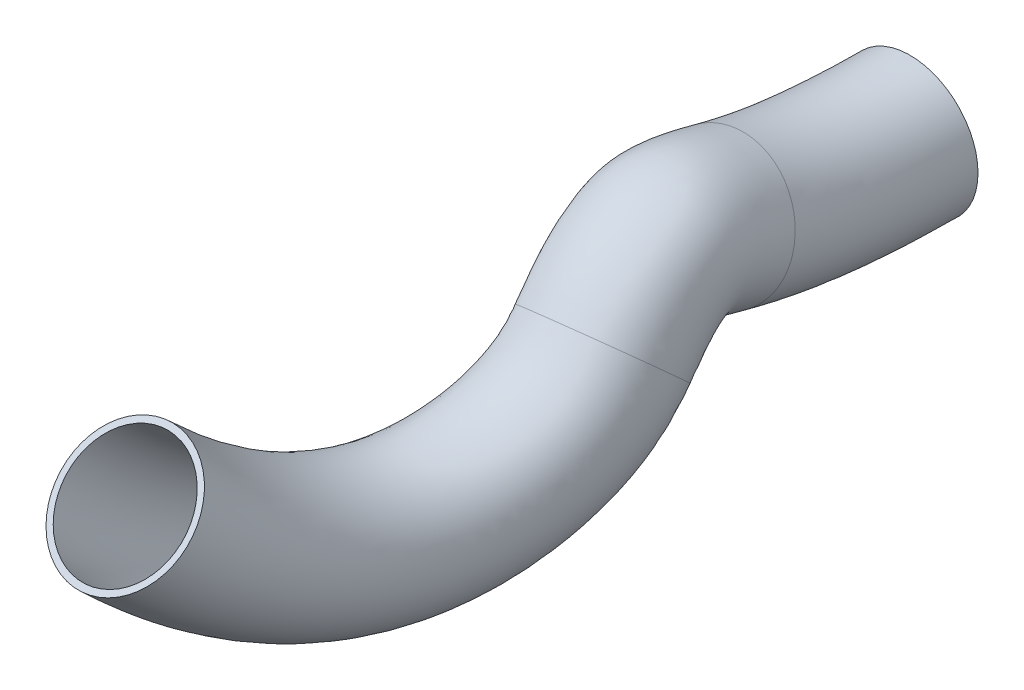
ISO-10303-21;
HEADER;
FILE_DESCRIPTION(('STEP AP214'),'2;1');
FILE_NAME('part.step','',(''),(''),'','','');
FILE_SCHEMA(('AUTOMOTIVE_DESIGN { 1 0 10303 214 1 1 1 1 }'));
ENDSEC;
DATA;
#1=APPLICATION_CONTEXT('core data for automotive mechanical design processes');
#2=APPLICATION_PROTOCOL_DEFINITION('international standard','automotive_design',2000,#1);
#3=PRODUCT_CONTEXT('',#1,'mechanical');
#4=PRODUCT('Part','Part','',(#3));
#5=PRODUCT_RELATED_PRODUCT_CATEGORY('part','',(#4));
#6=PRODUCT_DEFINITION_FORMATION('','',#4);
#7=PRODUCT_DEFINITION_CONTEXT('part definition',#1,'design');
#8=PRODUCT_DEFINITION('design','',#6,#7);
#9=PRODUCT_DEFINITION_SHAPE('','',#8);
#10=(LENGTH_UNIT() NAMED_UNIT(*) SI_UNIT(.MILLI.,.METRE.));
#11=(NAMED_UNIT(*) PLANE_ANGLE_UNIT() SI_UNIT($,.RADIAN.));
#12=(NAMED_UNIT(*) SI_UNIT($,.STERADIAN.) SOLID_ANGLE_UNIT());
#13=UNCERTAINTY_MEASURE_WITH_UNIT(LENGTH_MEASURE(1.E-05),#10,'distance_accuracy_value','');
#14=(GEOMETRIC_REPRESENTATION_CONTEXT(3) GLOBAL_UNCERTAINTY_ASSIGNED_CONTEXT((#13)) GLOBAL_UNIT_ASSIGNED_CONTEXT((#10,
#11,#12)) REPRESENTATION_CONTEXT('',''));
#15=CARTESIAN_POINT('',(0.,0.,0.));
#16=DIRECTION('',(0.,0.,1.));
#17=DIRECTION('',(1.,0.,0.));
#18=AXIS2_PLACEMENT_3D('',#15,#16,#17);
#19=CARTESIAN_POINT('',(36.9537950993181,-11.5900509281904,156.646188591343));
#20=CARTESIAN_POINT('',(36.9862210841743,-12.1073534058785,157.085547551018));
#21=CARTESIAN_POINT('',(37.0169216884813,-12.6294352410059,157.530037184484));
#22=CARTESIAN_POINT('',(37.1675436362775,-15.3942807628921,159.8958218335));
#23=CARTESIAN_POINT('',(37.2526682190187,-17.7116395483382,161.920428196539));
#24=CARTESIAN_POINT('',(37.3040136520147,-22.4173310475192,166.319140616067));
#25=CARTESIAN_POINT('',(37.2700066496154,-24.8045686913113,168.693395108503));
#26=CARTESIAN_POINT('',(37.0461843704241,-29.5577467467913,173.905724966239));
#27=CARTESIAN_POINT('',(36.8564566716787,-31.9229290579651,176.743229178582));
#28=CARTESIAN_POINT('',(36.4360536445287,-35.4063544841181,181.424148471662));
#29=CARTESIAN_POINT('',(36.2733607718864,-36.557069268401,183.055208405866));
#30=CARTESIAN_POINT('',(35.9935496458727,-38.2641850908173,185.61810067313));
#31=CARTESIAN_POINT('',(35.8943187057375,-38.8300857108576,186.491785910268));
#32=CARTESIAN_POINT('',(35.7362984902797,-39.6739571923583,187.832740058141));
#33=CARTESIAN_POINT('',(35.6414441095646,-40.1647675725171,188.623836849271));
#34=CARTESIAN_POINT('',(35.5418480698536,-40.6529836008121,189.430820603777));
#35=CARTESIAN_POINT('',(35.4837635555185,-40.9313236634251,189.895909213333));
#36=CARTESIAN_POINT('',(35.4701524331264,-40.9906703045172,190.018510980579));
#37=CARTESIAN_POINT('',(34.7379751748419,-45.2464903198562,193.815332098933));
#38=CARTESIAN_POINT('',(33.8024904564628,-48.9008243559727,198.44238711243));
#39=CARTESIAN_POINT('',(31.7096556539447,-55.3126371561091,209.087046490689));
#40=CARTESIAN_POINT('',(30.5409472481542,-58.0678963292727,215.109389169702));
#41=CARTESIAN_POINT('',(27.9962657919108,-62.5082979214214,228.308513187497));
#42=CARTESIAN_POINT('',(26.6184323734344,-64.1893518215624,235.488811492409));
#43=CARTESIAN_POINT('',(23.6736693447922,-66.1695121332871,250.83843879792));
#44=CARTESIAN_POINT('',(22.1066059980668,-66.4662429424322,259.008721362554));
#45=CARTESIAN_POINT('',(18.8142954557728,-65.3297758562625,276.175976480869));
#46=CARTESIAN_POINT('',(17.0892973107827,-63.8955677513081,285.172379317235));
#47=CARTESIAN_POINT('',(13.5193366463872,-58.9634257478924,303.831122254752));
#48=CARTESIAN_POINT('',(11.6746122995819,-55.4657894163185,313.492719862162));
#49=CARTESIAN_POINT('',(7.90204719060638,-46.0968941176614,333.347816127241));
#50=CARTESIAN_POINT('',(5.97425112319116,-40.2263801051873,343.541325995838));
#51=CARTESIAN_POINT('',(2.06632556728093,-25.8062418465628,364.366323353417));
#52=CARTESIAN_POINT('',(0.0861121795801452,-17.2569943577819,374.998338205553));
#53=CARTESIAN_POINT('',(-1.90741466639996,-7.20801981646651,385.8175674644));
#54=CARTESIAN_POINT('',(41.468354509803,35.5504940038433,207.993004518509));
#55=CARTESIAN_POINT('',(41.5019894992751,35.0962592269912,208.373969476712));
#56=CARTESIAN_POINT('',(41.5331388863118,34.6589638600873,208.739943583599));
#57=CARTESIAN_POINT('',(41.6839882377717,32.4510693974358,210.589261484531));
#58=CARTESIAN_POINT('',(41.7635165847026,30.9658294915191,211.835491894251));
#59=CARTESIAN_POINT('',(41.8649498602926,28.3981348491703,214.051138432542));
#60=CARTESIAN_POINT('',(41.8881113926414,27.3108786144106,215.019761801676));
#61=CARTESIAN_POINT('',(41.8824554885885,25.2510732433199,216.988003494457));
#62=CARTESIAN_POINT('',(41.8535903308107,24.2744446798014,217.98987770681));
#63=CARTESIAN_POINT('',(41.7418023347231,22.7286931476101,219.797742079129));
#64=CARTESIAN_POINT('',(41.6928066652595,22.2009039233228,220.451450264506));
#65=CARTESIAN_POINT('',(41.5959085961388,21.3796786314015,221.54270432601));
#66=CARTESIAN_POINT('',(41.559707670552,21.1010770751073,221.924880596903));
#67=CARTESIAN_POINT('',(41.4987667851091,20.6751305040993,222.529782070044));
#68=CARTESIAN_POINT('',(41.4612873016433,20.4243183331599,222.891863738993));
#69=CARTESIAN_POINT('',(41.4202101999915,20.1692906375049,223.271065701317));
#70=CARTESIAN_POINT('',(41.3958260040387,20.0225082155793,223.492118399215));
#71=CARTESIAN_POINT('',(41.3671601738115,19.9989602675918,223.552452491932));
#72=CARTESIAN_POINT('',(44.3917178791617,16.6072011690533,225.102280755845));
#73=CARTESIAN_POINT('',(46.0207141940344,13.6253695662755,227.289300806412));
#74=CARTESIAN_POINT('',(48.1252301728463,8.47541769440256,232.593796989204));
#75=CARTESIAN_POINT('',(48.5814134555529,6.28652882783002,235.705892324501));
#76=CARTESIAN_POINT('',(48.9190251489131,2.67428816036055,242.613582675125));
#77=CARTESIAN_POINT('',(48.7895361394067,1.24855354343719,246.410261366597));
#78=CARTESIAN_POINT('',(48.1782711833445,-0.764549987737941,254.668684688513));
#79=CARTESIAN_POINT('',(47.6921437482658,-1.35386262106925,259.133224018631));
#80=CARTESIAN_POINT('',(46.4448383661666,-1.47471970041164,268.872400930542));
#81=CARTESIAN_POINT('',(45.6812652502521,-1.00627383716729,274.151766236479));
#82=CARTESIAN_POINT('',(43.8989420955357,1.39258167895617,285.71345759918));
#83=CARTESIAN_POINT('',(42.8789056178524,3.32617205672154,291.999176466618));
#84=CARTESIAN_POINT('',(40.599743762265,9.1971049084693,305.678168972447));
#85=CARTESIAN_POINT('',(39.3403956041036,13.1379877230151,313.071258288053));
#86=CARTESIAN_POINT('',(36.6169091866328,23.5892344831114,328.928709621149));
#87=CARTESIAN_POINT('',(35.1530740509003,30.1010326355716,337.391000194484));
#88=CARTESIAN_POINT('',(33.6113032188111,38.1517827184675,346.321599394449));
#89=CARTESIAN_POINT('',(-27.9788192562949,34.1799962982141,215.3577134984));
#90=CARTESIAN_POINT('',(-27.9578619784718,33.8455622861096,215.641271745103));
#91=CARTESIAN_POINT('',(-27.9395915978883,33.5357264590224,215.904473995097));
#92=CARTESIAN_POINT('',(-27.8563819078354,32.0346183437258,217.186770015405));
#93=CARTESIAN_POINT('',(-27.830965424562,31.2488439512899,217.878744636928));
#94=CARTESIAN_POINT('',(-27.8052144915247,30.191022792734,218.830958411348));
#95=CARTESIAN_POINT('',(-27.8031677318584,29.9119843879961,219.09010792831));
#96=CARTESIAN_POINT('',(-27.8040034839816,29.4255153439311,219.553022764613));
#97=CARTESIAN_POINT('',(-27.8071088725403,29.212489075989,219.760186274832));
#98=CARTESIAN_POINT('',(-27.8515349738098,28.705941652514,220.380493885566));
#99=CARTESIAN_POINT('',(-27.8734430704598,28.5074492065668,220.639148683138));
#100=CARTESIAN_POINT('',(-27.9244507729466,28.1507399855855,221.146537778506));
#101=CARTESIAN_POINT('',(-27.9444812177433,28.0221150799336,221.335536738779));
#102=CARTESIAN_POINT('',(-27.9800848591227,27.8136529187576,221.653632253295));
#103=CARTESIAN_POINT('',(-28.0024683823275,27.6875335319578,221.849275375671));
#104=CARTESIAN_POINT('',(-28.0279564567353,27.5533661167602,222.063724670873));
#105=CARTESIAN_POINT('',(-28.0433219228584,27.4747145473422,222.191080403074));
#106=CARTESIAN_POINT('',(-28.0717392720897,27.447751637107,222.216027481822));
#107=CARTESIAN_POINT('',(-24.6680482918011,27.6899366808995,224.583511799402));
#108=CARTESIAN_POINT('',(-22.5100614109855,27.3059821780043,226.780970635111));
#109=CARTESIAN_POINT('',(-19.4141227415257,26.3827724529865,231.310356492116));
#110=CARTESIAN_POINT('',(-18.4727906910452,25.8183094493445,233.62742608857));
#111=CARTESIAN_POINT('',(-17.2030935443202,24.8744315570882,238.478873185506));
#112=CARTESIAN_POINT('',(-16.8819251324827,24.484456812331,241.007300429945));
#113=CARTESIAN_POINT('',(-16.608876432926,24.073768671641,246.451419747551));
#114=CARTESIAN_POINT('',(-16.6610801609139,24.0463603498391,249.36799939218));
#115=CARTESIAN_POINT('',(-17.0618162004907,24.6192911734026,255.915711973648));
#116=CARTESIAN_POINT('',(-17.4132417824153,25.217600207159,259.55271206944));
#117=CARTESIAN_POINT('',(-18.4114390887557,27.5136132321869,267.913208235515));
#118=CARTESIAN_POINT('',(-19.0599735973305,29.2150930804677,272.64158210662));
#119=CARTESIAN_POINT('',(-20.6524488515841,34.3744884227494,283.415067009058));
#120=CARTESIAN_POINT('',(-21.5967017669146,37.8374341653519,289.459971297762));
#121=CARTESIAN_POINT('',(-23.7503332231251,47.2095612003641,302.875656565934));
#122=CARTESIAN_POINT('',(-24.9592408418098,53.1209302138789,310.243311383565));
#123=CARTESIAN_POINT('',(-26.2731845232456,60.5568075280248,318.198912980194));
#124=CARTESIAN_POINT('',(-32.4933786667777,-12.9605486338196,164.010897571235));
#125=CARTESIAN_POINT('',(-32.4736303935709,-13.35805034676,164.35284981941));
#126=CARTESIAN_POINT('',(-32.4558087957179,-13.7526726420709,164.694567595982));
#127=CARTESIAN_POINT('',(-32.3728265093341,-15.8107318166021,166.493330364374));
#128=CARTESIAN_POINT('',(-32.3418137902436,-17.4286250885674,167.963680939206));
#129=CARTESIAN_POINT('',(-32.3661506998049,-20.6244431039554,171.098960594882));
#130=CARTESIAN_POINT('',(-32.4212724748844,-22.2034629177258,172.763741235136));
#131=CARTESIAN_POINT('',(-32.640274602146,-25.38330464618,176.470744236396));
#132=CARTESIAN_POINT('',(-32.8042425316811,-26.9848846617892,178.513537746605));
#133=CARTESIAN_POINT('',(-33.1572836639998,-29.4291059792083,182.006900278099));
#134=CARTESIAN_POINT('',(-33.2928889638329,-30.250523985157,183.242906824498));
#135=CARTESIAN_POINT('',(-33.5268097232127,-31.4931237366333,185.221934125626));
#136=CARTESIAN_POINT('',(-33.6098701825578,-31.9090477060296,185.902442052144));
#137=CARTESIAN_POINT('',(-33.7425531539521,-32.5354347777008,186.956590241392));
#138=CARTESIAN_POINT('',(-33.8223115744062,-32.9015523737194,187.581248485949));
#139=CARTESIAN_POINT('',(-33.9063185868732,-33.2689081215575,188.223479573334));
#140=CARTESIAN_POINT('',(-33.9553843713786,-33.479117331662,188.594871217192));
#141=CARTESIAN_POINT('',(-33.9687470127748,-33.5418789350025,188.682085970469));
#142=CARTESIAN_POINT('',(-34.3217909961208,-34.1637548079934,193.29656314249));
#143=CARTESIAN_POINT('',(-34.7282851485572,-35.2202117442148,197.934056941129));
#144=CARTESIAN_POINT('',(-35.8296972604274,-37.4052823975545,207.803605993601));
#145=CARTESIAN_POINT('',(-36.5132568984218,-38.5361157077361,213.030922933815));
#146=CARTESIAN_POINT('',(-38.1258529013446,-40.3081545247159,224.173803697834));
#147=CARTESIAN_POINT('',(-39.0530288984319,-40.9534485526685,230.085850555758));
#148=CARTESIAN_POINT('',(-41.1134782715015,-41.3311934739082,242.621173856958));
#149=CARTESIAN_POINT('',(-42.2466179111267,-41.0660199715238,249.243496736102));
#150=CARTESIAN_POINT('',(-44.6923591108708,-39.2357649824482,263.219287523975));
#151=CARTESIAN_POINT('',(-46.0052097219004,-37.6716937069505,270.573325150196));
#152=CARTESIAN_POINT('',(-48.7910445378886,-32.8423941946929,286.030872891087));
#153=CARTESIAN_POINT('',(-50.264266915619,-29.5768683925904,294.135125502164));
#154=CARTESIAN_POINT('',(-53.3501454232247,-20.9195106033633,311.084714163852));
#155=CARTESIAN_POINT('',(-54.962846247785,-15.5269336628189,319.930039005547));
#156=CARTESIAN_POINT('',(-58.3009168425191,-2.18591512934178,338.313270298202));
#157=CARTESIAN_POINT('',(-60.0262027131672,5.76290322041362,347.850649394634));
#158=CARTESIAN_POINT('',(-61.7919024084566,15.1970049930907,357.694881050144));
#159=CARTESIAN_POINT('',(-37.0079380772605,-60.1010935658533,112.66408164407));
#160=CARTESIAN_POINT('',(-36.9893988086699,-60.5616629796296,113.064427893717));
#161=CARTESIAN_POINT('',(-36.9720259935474,-61.0410717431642,113.484661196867));
#162=CARTESIAN_POINT('',(-36.8892711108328,-63.65608197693,115.799890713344));
#163=CARTESIAN_POINT('',(-36.8526621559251,-66.1060941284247,118.048617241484));
#164=CARTESIAN_POINT('',(-36.9270869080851,-71.4399090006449,123.366962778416));
#165=CARTESIAN_POINT('',(-37.0393772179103,-74.3189102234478,126.437374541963));
#166=CARTESIAN_POINT('',(-37.4765457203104,-80.1921246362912,133.388465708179));
#167=CARTESIAN_POINT('',(-37.801376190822,-83.1822583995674,137.266889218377));
#168=CARTESIAN_POINT('',(-38.4630323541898,-87.5641536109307,143.633306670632));
#169=CARTESIAN_POINT('',(-38.7123348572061,-89.0084971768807,145.846664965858));
#170=CARTESIAN_POINT('',(-39.1291686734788,-91.1369874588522,149.297330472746));
#171=CARTESIAN_POINT('',(-39.2752591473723,-91.8402104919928,150.469347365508));
#172=CARTESIAN_POINT('',(-39.5050214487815,-92.8845224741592,152.259548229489));
#173=CARTESIAN_POINT('',(-39.6421547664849,-93.4906382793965,153.313221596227));
#174=CARTESIAN_POINT('',(-39.7846807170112,-94.0911823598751,154.383234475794));
#175=CARTESIAN_POINT('',(-39.8674468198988,-94.4329492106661,154.998662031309));
#176=CARTESIAN_POINT('',(-39.86575475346,-94.531509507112,155.148144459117));
#177=CARTESIAN_POINT('',(-43.9755337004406,-96.0174462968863,162.009614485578));
#178=CARTESIAN_POINT('',(-46.9465088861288,-97.7464056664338,169.087143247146));
#179=CARTESIAN_POINT('',(-52.2452717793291,-101.193337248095,184.296855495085));
#180=CARTESIAN_POINT('',(-54.5537231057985,-102.890540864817,192.43441977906));
#181=CARTESIAN_POINT('',(-59.048612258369,-105.49074060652,209.868734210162));
#182=CARTESIAN_POINT('',(-61.2241326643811,-106.391353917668,219.16440068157));
#183=CARTESIAN_POINT('',(-65.618080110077,-106.736155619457,238.790927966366));
#184=CARTESIAN_POINT('',(-67.8321556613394,-106.178400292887,249.118994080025));
#185=CARTESIAN_POINT('',(-72.3229020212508,-103.090821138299,270.522863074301));
#186=CARTESIAN_POINT('',(-74.5971776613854,-100.56098762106,281.593938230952));
#187=CARTESIAN_POINT('',(-79.1706499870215,-93.1984016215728,304.148537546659));
#188=CARTESIAN_POINT('',(-81.4685602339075,-88.3688298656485,315.628668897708));
#189=CARTESIAN_POINT('',(-86.0478419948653,-76.2135096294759,338.754361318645));
#190=CARTESIAN_POINT('',(-88.3289907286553,-68.8913014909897,350.400106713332));
#191=CARTESIAN_POINT('',(-92.8515004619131,-51.5813914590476,373.750884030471));
#192=CARTESIAN_POINT('',(-95.0931645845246,-41.5951237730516,385.457987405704));
#193=CARTESIAN_POINT('',(-97.3106202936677,-30.1627975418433,397.190849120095));
#194=CARTESIAN_POINT('',(32.4392356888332,-58.7305958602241,105.299372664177));
#195=CARTESIAN_POINT('',(32.4704526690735,-59.3109660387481,105.797125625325));
#196=CARTESIAN_POINT('',(32.5007044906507,-59.9178343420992,106.32013078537));
#197=CARTESIAN_POINT('',(32.6510990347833,-63.23963092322,109.202382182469));
#198=CARTESIAN_POINT('',(32.7418198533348,-66.3891085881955,112.005364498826));
#199=CARTESIAN_POINT('',(32.7430774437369,-73.2327969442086,118.587142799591));
#200=CARTESIAN_POINT('',(32.6519019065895,-76.9200159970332,122.36702841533));
#201=CARTESIAN_POINT('',(32.2099132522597,-84.3665667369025,130.823446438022));
#202=CARTESIAN_POINT('',(31.8593230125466,-88.1203027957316,135.496580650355));
#203=CARTESIAN_POINT('',(31.1303049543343,-93.5414021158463,143.050554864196));
#204=CARTESIAN_POINT('',(30.8539148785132,-95.3150424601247,145.658966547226));
#205=CARTESIAN_POINT('',(30.3911906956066,-97.9080488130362,149.69349702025));
#206=CARTESIAN_POINT('',(30.2289297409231,-98.7612484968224,151.058691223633));
#207=CARTESIAN_POINT('',(29.9738301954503,-100.023044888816,153.135698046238));
#208=CARTESIAN_POINT('',(29.821600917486,-100.753853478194,154.355809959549));
#209=CARTESIAN_POINT('',(29.6634859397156,-101.475257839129,155.590575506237));
#210=CARTESIAN_POINT('',(29.5717011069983,-101.885155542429,156.299700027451));
#211=CARTESIAN_POINT('',(29.5731446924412,-101.980300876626,156.484569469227));
#212=CARTESIAN_POINT('',(25.0842324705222,-107.100181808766,162.528383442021));
#213=CARTESIAN_POINT('',(21.5842667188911,-111.427018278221,169.595473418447));
#214=CARTESIAN_POINT('',(15.294081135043,-119.100692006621,185.580295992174));
#215=CARTESIAN_POINT('',(12.5004810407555,-122.422321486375,194.512886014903));
#216=CARTESIAN_POINT('',(7.07350643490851,-127.690884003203,214.00344369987));
#217=CARTESIAN_POINT('',(4.44732860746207,-129.627257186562,224.567361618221));
#218=CARTESIAN_POINT('',(-0.830932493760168,-131.574474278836,247.008192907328));
#219=CARTESIAN_POINT('',(-3.47893175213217,-131.578623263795,258.884218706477));
#220=CARTESIAN_POINT('',(-8.81624745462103,-129.184832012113,283.479552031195));
#221=CARTESIAN_POINT('',(-11.5026706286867,-126.784861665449,296.192992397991));
#222=CARTESIAN_POINT('',(-16.8602688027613,-119.319433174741,321.948786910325));
#223=CARTESIAN_POINT('',(-19.5296810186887,-114.257750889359,334.986263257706));
#224=CARTESIAN_POINT('',(-24.7956493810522,-101.390893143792,361.017463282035));
#225=CARTESIAN_POINT('',(-27.3918933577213,-93.5907479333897,374.011393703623));
#226=CARTESIAN_POINT('',(-32.4842580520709,-75.2017181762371,399.803937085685));
#227=CARTESIAN_POINT('',(-34.98084969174,-64.6150213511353,412.605676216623));
#228=CARTESIAN_POINT('',(-37.426132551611,-52.5678223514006,425.31353553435));
#229=CARTESIAN_POINT('',(36.9537950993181,-11.5900509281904,156.646188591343));
#230=CARTESIAN_POINT('',(36.9862210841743,-12.1073534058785,157.085547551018));
#231=CARTESIAN_POINT('',(37.0169216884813,-12.6294352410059,157.530037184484));
#232=CARTESIAN_POINT('',(37.1675436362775,-15.3942807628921,159.8958218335));
#233=CARTESIAN_POINT('',(37.2526682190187,-17.7116395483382,161.920428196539));
#234=CARTESIAN_POINT('',(37.3040136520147,-22.4173310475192,166.319140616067));
#235=CARTESIAN_POINT('',(37.2700066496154,-24.8045686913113,168.693395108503));
#236=CARTESIAN_POINT('',(37.0461843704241,-29.5577467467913,173.905724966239));
#237=CARTESIAN_POINT('',(36.8564566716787,-31.9229290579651,176.743229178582));
#238=CARTESIAN_POINT('',(36.4360536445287,-35.4063544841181,181.424148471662));
#239=CARTESIAN_POINT('',(36.2733607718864,-36.557069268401,183.055208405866));
#240=CARTESIAN_POINT('',(35.9935496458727,-38.2641850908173,185.61810067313));
#241=CARTESIAN_POINT('',(35.8943187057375,-38.8300857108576,186.491785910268));
#242=CARTESIAN_POINT('',(35.7362984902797,-39.6739571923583,187.832740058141));
#243=CARTESIAN_POINT('',(35.6414441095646,-40.1647675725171,188.623836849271));
#244=CARTESIAN_POINT('',(35.5418480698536,-40.6529836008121,189.430820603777));
#245=CARTESIAN_POINT('',(35.4837635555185,-40.9313236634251,189.895909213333));
#246=CARTESIAN_POINT('',(35.4701524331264,-40.9906703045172,190.018510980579));
#247=CARTESIAN_POINT('',(34.7379751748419,-45.2464903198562,193.815332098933));
#248=CARTESIAN_POINT('',(33.8024904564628,-48.9008243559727,198.44238711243));
#249=CARTESIAN_POINT('',(31.7096556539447,-55.3126371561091,209.087046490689));
#250=CARTESIAN_POINT('',(30.5409472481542,-58.0678963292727,215.109389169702));
#251=CARTESIAN_POINT('',(27.9962657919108,-62.5082979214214,228.308513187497));
#252=CARTESIAN_POINT('',(26.6184323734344,-64.1893518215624,235.488811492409));
#253=CARTESIAN_POINT('',(23.6736693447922,-66.1695121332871,250.83843879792));
#254=CARTESIAN_POINT('',(22.1066059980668,-66.4662429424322,259.008721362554));
#255=CARTESIAN_POINT('',(18.8142954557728,-65.3297758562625,276.175976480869));
#256=CARTESIAN_POINT('',(17.0892973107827,-63.8955677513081,285.172379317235));
#257=CARTESIAN_POINT('',(13.5193366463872,-58.9634257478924,303.831122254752));
#258=CARTESIAN_POINT('',(11.6746122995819,-55.4657894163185,313.492719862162));
#259=CARTESIAN_POINT('',(7.90204719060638,-46.0968941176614,333.347816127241));
#260=CARTESIAN_POINT('',(5.97425112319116,-40.2263801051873,343.541325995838));
#261=CARTESIAN_POINT('',(2.06632556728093,-25.8062418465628,364.366323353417));
#262=CARTESIAN_POINT('',(0.0861121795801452,-17.2569943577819,374.998338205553));
#263=CARTESIAN_POINT('',(-1.90741466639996,-7.20801981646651,385.8175674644));
#264=(BOUNDED_SURFACE() B_SPLINE_SURFACE(3,3,((#19,#20,#21,#22,#23,#24,#25,#26,#27,#28,#29,#30,
#31,#32,#33,#34,#35,#36,#37,#38,#39,#40,#41,#42,#43,#44,#45,#46,#47,#48,#49,#50,#51,#52,#53),
(#54,#55,#56,#57,#58,#59,#60,#61,#62,#63,#64,#65,#66,#67,#68,#69,#70,#71,#72,#73,#74,#75,#76,
#77,#78,#79,#80,#81,#82,#83,#84,#85,#86,#87,#88),(#89,#90,#91,#92,#93,#94,#95,#96,#97,#98,#99,
#100,#101,#102,#103,#104,#105,#106,#107,#108,#109,#110,#111,#112,#113,#114,#115,#116,#117,#118,
#119,#120,#121,#122,#123),(#124,#125,#126,#127,#128,#129,#130,#131,#132,#133,#134,#135,#136,
#137,#138,#139,#140,#141,#142,#143,#144,#145,#146,#147,#148,#149,#150,#151,#152,#153,#154,#155,
#156,#157,#158),(#159,#160,#161,#162,#163,#164,#165,#166,#167,#168,#169,#170,#171,#172,#173,
#174,#175,#176,#177,#178,#179,#180,#181,#182,#183,#184,#185,#186,#187,#188,#189,#190,#191,#192,
#193),(#194,#195,#196,#197,#198,#199,#200,#201,#202,#203,#204,#205,#206,#207,#208,#209,#210,
#211,#212,#213,#214,#215,#216,#217,#218,#219,#220,#221,#222,#223,#224,#225,#226,#227,#228),
(#229,#230,#231,#232,#233,#234,#235,#236,#237,#238,#239,#240,#241,#242,#243,#244,#245,#246,#247,
#248,#249,#250,#251,#252,#253,#254,#255,#256,#257,#258,#259,#260,#261,#262,#263)),.UNSPECIFIED.,
.T.,.F.,.F.) B_SPLINE_SURFACE_WITH_KNOTS((4,3,4),(4,2,2,2,2,2,2,1,2,2,2,2,2,2,2,2,2,4),(0.,0.5,
1.),(0.46275260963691,0.471795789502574,0.51024186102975,0.548687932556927,0.587134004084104,
0.606357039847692,0.615968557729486,0.620774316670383,0.624378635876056,0.62558007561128,
0.67238256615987,0.71918505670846,0.76598754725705,0.81279003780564,0.85959252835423,
0.90639501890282,0.95319750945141,1.),
.UNSPECIFIED.) GEOMETRIC_REPRESENTATION_ITEM() RATIONAL_B_SPLINE_SURFACE(((1.,1.,1.,1.,1.,1.,1.,
1.,1.,1.,1.,1.,1.,1.,1.,1.,1.,1.,1.,1.,1.,1.,1.,1.,1.,1.,1.,1.,1.,1.,1.,1.,1.,1.,1.),
(0.333333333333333,0.333333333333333,0.333333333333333,0.333333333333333,0.333333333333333,
0.333333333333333,0.333333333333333,0.333333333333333,0.333333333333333,0.333333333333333,
0.333333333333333,0.333333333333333,0.333333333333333,0.333333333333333,0.333333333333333,
0.333333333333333,0.333333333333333,0.333333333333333,0.333333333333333,0.333333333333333,
0.333333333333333,0.333333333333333,0.333333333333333,0.333333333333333,0.333333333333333,
0.333333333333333,0.333333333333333,0.333333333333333,0.333333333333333,0.333333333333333,
0.333333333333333,0.333333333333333,0.333333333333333,0.333333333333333,0.333333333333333),
(0.333333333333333,0.333333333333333,0.333333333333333,0.333333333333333,0.333333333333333,
0.333333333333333,0.333333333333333,0.333333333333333,0.333333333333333,0.333333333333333,
0.333333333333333,0.333333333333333,0.333333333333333,0.333333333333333,0.333333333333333,
0.333333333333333,0.333333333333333,0.333333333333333,0.333333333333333,0.333333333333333,
0.333333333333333,0.333333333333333,0.333333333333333,0.333333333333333,0.333333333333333,
0.333333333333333,0.333333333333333,0.333333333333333,0.333333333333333,0.333333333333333,
0.333333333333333,0.333333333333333,0.333333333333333,0.333333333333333,0.333333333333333),(1.,
1.,1.,1.,1.,1.,1.,1.,1.,1.,1.,1.,1.,1.,1.,1.,1.,1.,1.,1.,1.,1.,1.,1.,1.,1.,1.,1.,1.,1.,1.,1.,1.,
1.,1.),(0.333333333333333,0.333333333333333,0.333333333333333,0.333333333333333,
0.333333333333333,0.333333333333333,0.333333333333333,0.333333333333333,0.333333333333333,
0.333333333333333,0.333333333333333,0.333333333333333,0.333333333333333,0.333333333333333,
0.333333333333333,0.333333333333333,0.333333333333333,0.333333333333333,0.333333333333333,
0.333333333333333,0.333333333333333,0.333333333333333,0.333333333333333,0.333333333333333,
0.333333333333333,0.333333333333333,0.333333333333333,0.333333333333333,0.333333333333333,
0.333333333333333,0.333333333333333,0.333333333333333,0.333333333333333,0.333333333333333,
0.333333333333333),(0.333333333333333,0.333333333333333,0.333333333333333,0.333333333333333,
0.333333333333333,0.333333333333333,0.333333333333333,0.333333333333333,0.333333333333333,
0.333333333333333,0.333333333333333,0.333333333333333,0.333333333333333,0.333333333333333,
0.333333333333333,0.333333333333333,0.333333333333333,0.333333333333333,0.333333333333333,
0.333333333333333,0.333333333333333,0.333333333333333,0.333333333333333,0.333333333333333,
0.333333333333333,0.333333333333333,0.333333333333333,0.333333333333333,0.333333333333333,
0.333333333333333,0.333333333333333,0.333333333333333,0.333333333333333,0.333333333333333,
0.333333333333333),(1.,1.,1.,1.,1.,1.,1.,1.,1.,1.,1.,1.,1.,1.,1.,1.,1.,1.,1.,1.,1.,1.,1.,1.,1.,
1.,1.,1.,1.,1.,1.,1.,1.,1.,1.))) REPRESENTATION_ITEM('') SURFACE());
#265=CARTESIAN_POINT('',(36.9537950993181,-11.5900509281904,156.646188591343));
#266=CARTESIAN_POINT('',(41.468354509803,35.5504940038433,207.993004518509));
#267=CARTESIAN_POINT('',(-27.9788192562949,34.1799962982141,215.3577134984));
#268=CARTESIAN_POINT('',(-32.4933786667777,-12.9605486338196,164.010897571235));
#269=CARTESIAN_POINT('',(-37.0079380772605,-60.1010935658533,112.66408164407));
#270=CARTESIAN_POINT('',(32.4392356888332,-58.7305958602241,105.299372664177));
#271=CARTESIAN_POINT('',(36.9537950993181,-11.5900509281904,156.646188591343));
#272=(BOUNDED_CURVE() B_SPLINE_CURVE(3,(#265,#266,#267,#268,#269,#270,#271),.UNSPECIFIED.,.T.,
.F.) B_SPLINE_CURVE_WITH_KNOTS((4,3,4),(0.,0.5,1.),
.UNSPECIFIED.) CURVE() GEOMETRIC_REPRESENTATION_ITEM() RATIONAL_B_SPLINE_CURVE((1.,
0.333333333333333,0.333333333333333,1.,0.333333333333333,0.333333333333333,1.)) REPRESENTATION_ITEM(''));
#273=CARTESIAN_POINT('',(36.9537950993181,-11.5900509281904,156.646188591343));
#274=VERTEX_POINT('',#273);
#275=EDGE_CURVE('E70',#274,#274,#272,.F.);
#276=CARTESIAN_POINT('',(-31.8496585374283,3.99449258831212,371.756224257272));
#277=DIRECTION('',(-0.0800839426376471,0.689498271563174,0.719846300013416));
#278=DIRECTION('',(0.857329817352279,-0.320759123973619,0.402615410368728));
#279=AXIS2_PLACEMENT_3D('',#276,#277,#278);
#280=CIRCLE('',#279,34.925);
#281=CARTESIAN_POINT('',(-1.90741466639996,-7.20801981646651,385.8175674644));
#282=VERTEX_POINT('',#281);
#283=EDGE_CURVE('E51',#282,#282,#280,.T.);
#284=ORIENTED_EDGE('',*,*,#275,.F.);
#285=EDGE_LOOP('',(#284));
#286=FACE_BOUND('',#285,.T.);
#287=ORIENTED_EDGE('',*,*,#283,.F.);
#288=EDGE_LOOP('',(#287));
#289=FACE_BOUND('',#288,.T.);
#290=ADVANCED_FACE('F35',(#286,#289),#264,.T.);
#291=CARTESIAN_POINT('',(34.925,0.,0.));
#292=CARTESIAN_POINT('',(34.4818761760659,-0.389851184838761,10.8975471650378));
#293=CARTESIAN_POINT('',(34.1280865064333,-0.390995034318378,20.7216903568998));
#294=CARTESIAN_POINT('',(33.571452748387,0.178753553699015,38.4809745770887));
#295=CARTESIAN_POINT('',(33.3686085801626,0.749580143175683,46.4160794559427));
#296=CARTESIAN_POINT('',(33.0858315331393,2.25862021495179,60.6561203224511));
#297=CARTESIAN_POINT('',(33.0058902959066,3.19668570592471,66.9610171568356));
#298=CARTESIAN_POINT('',(32.9406690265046,5.23934277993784,78.2017246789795));
#299=CARTESIAN_POINT('',(32.955362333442,6.34366053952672,83.1374785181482));
#300=CARTESIAN_POINT('',(33.0271791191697,7.97652211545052,89.6919402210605));
#301=CARTESIAN_POINT('',(33.0591251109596,8.51424576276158,91.7273442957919));
#302=CARTESIAN_POINT('',(33.0976348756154,9.03847981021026,93.6438197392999));
#303=CARTESIAN_POINT('',(34.925,69.85,0.));
#304=CARTESIAN_POINT('',(34.5363260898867,69.460148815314,9.38416430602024));
#305=CARTESIAN_POINT('',(34.2336572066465,69.409437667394,17.6003126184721));
#306=CARTESIAN_POINT('',(33.7641736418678,69.7478029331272,32.0029519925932));
#307=CARTESIAN_POINT('',(33.5972548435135,70.1355861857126,38.1878988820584));
#308=CARTESIAN_POINT('',(33.3612941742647,71.1370464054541,48.9147577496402));
#309=CARTESIAN_POINT('',(33.291919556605,71.7484593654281,53.4546972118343));
#310=CARTESIAN_POINT('',(33.2173447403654,73.0620979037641,61.4134698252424));
#311=CARTESIAN_POINT('',(33.2114525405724,73.7620818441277,64.8294145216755));
#312=CARTESIAN_POINT('',(33.2400236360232,74.8895081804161,69.6422399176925));
#313=CARTESIAN_POINT('',(33.2553293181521,75.2768328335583,71.1863713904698));
#314=CARTESIAN_POINT('',(33.2786708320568,75.6892325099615,72.7456551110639));
#315=CARTESIAN_POINT('',(-34.925,69.85,0.));
#316=CARTESIAN_POINT('',(-35.3136739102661,69.514598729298,9.58230528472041));
#317=CARTESIAN_POINT('',(-35.6154607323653,69.5277693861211,18.0162751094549));
#318=CARTESIAN_POINT('',(-36.0799911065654,70.0189214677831,32.9004203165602));
#319=CARTESIAN_POINT('',(-36.2428386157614,70.4957414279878,39.3491238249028));
#320=CARTESIAN_POINT('',(-36.4654195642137,71.7049997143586,50.6538055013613));
#321=CARTESIAN_POINT('',(-36.525469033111,72.4354700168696,55.5078894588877));
#322=CARTESIAN_POINT('',(-36.5736767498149,74.0140721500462,64.1452084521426));
#323=CARTESIAN_POINT('',(-36.5624736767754,74.8605099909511,67.9256687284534));
#324=CARTESIAN_POINT('',(-36.5011104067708,76.2102316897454,73.3157264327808));
#325=CARTESIAN_POINT('',(-36.4737233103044,76.671905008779,75.0564830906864));
#326=CARTESIAN_POINT('',(-36.437169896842,77.1555786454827,76.8163591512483));
#327=CARTESIAN_POINT('',(-34.925,0.,0.));
#328=CARTESIAN_POINT('',(-35.3681238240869,-0.335401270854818,11.095688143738));
#329=CARTESIAN_POINT('',(-35.7210314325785,-0.272663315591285,21.1376528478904));
#330=CARTESIAN_POINT('',(-36.2727120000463,0.449872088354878,39.3784429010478));
#331=CARTESIAN_POINT('',(-36.4714848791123,1.10973538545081,47.5773043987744));
#332=CARTESIAN_POINT('',(-36.7408822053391,2.8265735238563,62.3951680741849));
#333=CARTESIAN_POINT('',(-36.8114982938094,3.88369635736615,69.014209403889));
#334=CARTESIAN_POINT('',(-36.8503524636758,6.19131702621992,80.9334633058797));
#335=CARTESIAN_POINT('',(-36.8185638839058,7.44208868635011,86.2337327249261));
#336=CARTESIAN_POINT('',(-36.7139549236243,9.29724562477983,93.3654267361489));
#337=CARTESIAN_POINT('',(-36.6699275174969,9.90931793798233,95.5974559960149));
#338=CARTESIAN_POINT('',(-36.6182058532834,10.5048259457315,97.714523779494));
#339=CARTESIAN_POINT('',(-34.925,-69.85,0.));
#340=CARTESIAN_POINT('',(-35.4225737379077,-70.1854012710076,12.6090710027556));
#341=CARTESIAN_POINT('',(-35.8266021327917,-70.0730960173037,24.259030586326));
#342=CARTESIAN_POINT('',(-36.4654328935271,-69.1191772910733,45.8564654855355));
#343=CARTESIAN_POINT('',(-36.7001311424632,-68.2762706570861,55.805484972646));
#344=CARTESIAN_POINT('',(-37.0163448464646,-66.0518526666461,74.1365306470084));
#345=CARTESIAN_POINT('',(-37.0975275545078,-64.6680773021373,82.5205293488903));
#346=CARTESIAN_POINT('',(-37.1270281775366,-61.6314380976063,97.7217181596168));
#347=CARTESIAN_POINT('',(-37.0746540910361,-59.9763326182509,104.541796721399));
#348=CARTESIAN_POINT('',(-36.9267994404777,-57.6157404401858,113.415127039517));
#349=CARTESIAN_POINT('',(-36.8661317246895,-56.8532691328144,116.138428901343));
#350=CARTESIAN_POINT('',(-36.7992418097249,-56.1459267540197,118.61268840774));
#351=CARTESIAN_POINT('',(34.925,-69.85,0.));
#352=CARTESIAN_POINT('',(34.4274262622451,-70.2398511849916,12.4109300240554));
#353=CARTESIAN_POINT('',(34.0225158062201,-70.1914277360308,23.8430680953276));
#354=CARTESIAN_POINT('',(33.3787318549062,-69.3902958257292,44.9589971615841));
#355=CARTESIAN_POINT('',(33.1399623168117,-68.6364258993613,54.644260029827));
#356=CARTESIAN_POINT('',(32.8103688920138,-66.6198059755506,72.397482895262));
#357=CARTESIAN_POINT('',(32.7198610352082,-65.3550879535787,80.4673371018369));
#358=CARTESIAN_POINT('',(32.6639933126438,-62.5834123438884,94.9899795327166));
#359=CARTESIAN_POINT('',(32.6992721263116,-61.0747607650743,101.445542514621));
#360=CARTESIAN_POINT('',(32.8143346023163,-58.9364639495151,109.741640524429));
#361=CARTESIAN_POINT('',(32.8629209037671,-58.2483413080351,112.268317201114));
#362=CARTESIAN_POINT('',(32.9165989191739,-57.6122728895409,114.541984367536));
#363=CARTESIAN_POINT('',(34.925,0.,0.));
#364=CARTESIAN_POINT('',(34.4818761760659,-0.389851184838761,10.8975471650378));
#365=CARTESIAN_POINT('',(34.1280865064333,-0.390995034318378,20.7216903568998));
#366=CARTESIAN_POINT('',(33.571452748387,0.178753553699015,38.4809745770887));
#367=CARTESIAN_POINT('',(33.3686085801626,0.749580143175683,46.4160794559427));
#368=CARTESIAN_POINT('',(33.0858315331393,2.25862021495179,60.6561203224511));
#369=CARTESIAN_POINT('',(33.0058902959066,3.19668570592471,66.9610171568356));
#370=CARTESIAN_POINT('',(32.9406690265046,5.23934277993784,78.2017246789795));
#371=CARTESIAN_POINT('',(32.955362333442,6.34366053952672,83.1374785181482));
#372=CARTESIAN_POINT('',(33.0271791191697,7.97652211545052,89.6919402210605));
#373=CARTESIAN_POINT('',(33.0591251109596,8.51424576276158,91.7273442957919));
#374=CARTESIAN_POINT('',(33.0976348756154,9.03847981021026,93.6438197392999));
#375=(BOUNDED_SURFACE() B_SPLINE_SURFACE(3,3,((#291,#292,#293,#294,#295,#296,#297,#298,#299,
#300,#301,#302),(#303,#304,#305,#306,#307,#308,#309,#310,#311,#312,#313,#314),(#315,#316,#317,
#318,#319,#320,#321,#322,#323,#324,#325,#326),(#327,#328,#329,#330,#331,#332,#333,#334,#335,
#336,#337,#338),(#339,#340,#341,#342,#343,#344,#345,#346,#347,#348,#349,#350),(#351,#352,#353,
#354,#355,#356,#357,#358,#359,#360,#361,#362),(#363,#364,#365,#366,#367,#368,#369,#370,#371,
#372,#373,#374)),.UNSPECIFIED.,.T.,.F.,.F.) B_SPLINE_SURFACE_WITH_KNOTS((4,3,4),(4,2,2,2,2,4),
(0.,0.5,1.),(0.,0.0319316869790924,0.0638633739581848,0.0957950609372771,0.12772674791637,
0.143540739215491),
.UNSPECIFIED.) GEOMETRIC_REPRESENTATION_ITEM() RATIONAL_B_SPLINE_SURFACE(((1.,1.,1.,1.,1.,1.,1.,
1.,1.,1.,1.,1.),(0.333333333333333,0.333333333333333,0.333333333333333,0.333333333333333,
0.333333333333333,0.333333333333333,0.333333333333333,0.333333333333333,0.333333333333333,
0.333333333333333,0.333333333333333,0.333333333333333),(0.333333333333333,0.333333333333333,
0.333333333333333,0.333333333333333,0.333333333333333,0.333333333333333,0.333333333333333,
0.333333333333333,0.333333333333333,0.333333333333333,0.333333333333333,0.333333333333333),(1.,
1.,1.,1.,1.,1.,1.,1.,1.,1.,1.,1.),(0.333333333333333,0.333333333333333,0.333333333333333,
0.333333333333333,0.333333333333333,0.333333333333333,0.333333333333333,0.333333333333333,
0.333333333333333,0.333333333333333,0.333333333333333,0.333333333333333),(0.333333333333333,
0.333333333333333,0.333333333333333,0.333333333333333,0.333333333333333,0.333333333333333,
0.333333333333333,0.333333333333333,0.333333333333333,0.333333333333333,0.333333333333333,
0.333333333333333),(1.,1.,1.,1.,1.,1.,1.,1.,1.,1.,1.,1.))) REPRESENTATION_ITEM('') SURFACE());
#376=CARTESIAN_POINT('',(0.,0.,0.));
#377=DIRECTION('',(0.,0.,1.));
#378=DIRECTION('',(1.,0.,0.));
#379=AXIS2_PLACEMENT_3D('',#376,#377,#378);
#380=CIRCLE('',#379,34.925);
#381=CARTESIAN_POINT('',(34.925,0.,0.));
#382=VERTEX_POINT('',#381);
#383=EDGE_CURVE('E57',#382,#382,#380,.T.);
#384=CARTESIAN_POINT('',(33.0976348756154,9.03847981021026,93.6438197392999));
#385=CARTESIAN_POINT('',(33.2786708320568,75.6892325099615,72.7456551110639));
#386=CARTESIAN_POINT('',(-36.437169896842,77.1555786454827,76.8163591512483));
#387=CARTESIAN_POINT('',(-36.6182058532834,10.5048259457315,97.714523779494));
#388=CARTESIAN_POINT('',(-36.7992418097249,-56.1459267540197,118.61268840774));
#389=CARTESIAN_POINT('',(32.9165989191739,-57.6122728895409,114.541984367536));
#390=CARTESIAN_POINT('',(33.0976348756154,9.03847981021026,93.6438197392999));
#391=(BOUNDED_CURVE() B_SPLINE_CURVE(3,(#384,#385,#386,#387,#388,#389,#390),.UNSPECIFIED.,.T.,
.F.) B_SPLINE_CURVE_WITH_KNOTS((4,3,4),(0.,0.5,1.),
.UNSPECIFIED.) CURVE() GEOMETRIC_REPRESENTATION_ITEM() RATIONAL_B_SPLINE_CURVE((1.,
0.333333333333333,0.333333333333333,1.,0.333333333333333,0.333333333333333,1.)) REPRESENTATION_ITEM(''));
#392=CARTESIAN_POINT('',(33.0976348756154,9.03847981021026,93.6438197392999));
#393=VERTEX_POINT('',#392);
#394=EDGE_CURVE('E91',#393,#393,#391,.T.);
#395=ORIENTED_EDGE('',*,*,#383,.T.);
#396=EDGE_LOOP('',(#395));
#397=FACE_BOUND('',#396,.T.);
#398=ORIENTED_EDGE('',*,*,#394,.F.);
#399=EDGE_LOOP('',(#398));
#400=FACE_BOUND('',#399,.T.);
#401=ADVANCED_FACE('F125',(#397,#400),#375,.T.);
#402=CARTESIAN_POINT('',(33.0976348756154,9.03847981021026,93.6438197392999));
#403=CARTESIAN_POINT('',(33.3567466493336,12.5657725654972,106.538766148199));
#404=CARTESIAN_POINT('',(34.5077855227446,18.7780183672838,122.246993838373));
#405=CARTESIAN_POINT('',(35.3738068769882,4.37575018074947,143.298944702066));
#406=CARTESIAN_POINT('',(36.5722641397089,-5.50336114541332,151.476598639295));
#407=CARTESIAN_POINT('',(36.9537950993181,-11.5900509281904,156.646188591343));
#408=CARTESIAN_POINT('',(33.2786708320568,75.6892325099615,72.7456551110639));
#409=CARTESIAN_POINT('',(33.4357234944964,78.4640511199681,83.2372479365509));
#410=CARTESIAN_POINT('',(36.5269809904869,94.8493588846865,133.702865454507));
#411=CARTESIAN_POINT('',(39.4284484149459,54.4066377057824,194.507620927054));
#412=CARTESIAN_POINT('',(41.0725981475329,40.8951159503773,203.510490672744));
#413=CARTESIAN_POINT('',(41.468354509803,35.5504940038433,207.993004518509));
#414=CARTESIAN_POINT('',(-36.437169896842,77.1555786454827,76.8163591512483));
#415=CARTESIAN_POINT('',(-36.1912213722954,80.4099619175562,88.6576314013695));
#416=CARTESIAN_POINT('',(-32.9616674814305,96.3641954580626,140.976421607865));
#417=CARTESIAN_POINT('',(-29.8659635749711,51.7635369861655,202.996817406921));
#418=CARTESIAN_POINT('',(-28.2254069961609,38.1150172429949,212.021307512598));
#419=CARTESIAN_POINT('',(-27.9788192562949,34.1799962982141,215.3577134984));
#420=CARTESIAN_POINT('',(-36.6182058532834,10.5048259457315,97.714523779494));
#421=CARTESIAN_POINT('',(-36.2701982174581,14.5116833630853,111.95914961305));
#422=CARTESIAN_POINT('',(-34.980862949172,20.2928549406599,129.520549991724));
#423=CARTESIAN_POINT('',(-33.920605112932,1.73264946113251,151.788141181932));
#424=CARTESIAN_POINT('',(-32.7257410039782,-8.28345985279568,159.987415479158));
#425=CARTESIAN_POINT('',(-32.4933786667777,-12.9605486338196,164.010897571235));
#426=CARTESIAN_POINT('',(-36.7992418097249,-56.1459267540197,118.61268840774));
#427=CARTESIAN_POINT('',(-36.3491750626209,-51.3865951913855,135.260667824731));
#428=CARTESIAN_POINT('',(-37.0000584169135,-55.7784855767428,118.064678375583));
#429=CARTESIAN_POINT('',(-37.9752466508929,-48.2982380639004,100.579464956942));
#430=CARTESIAN_POINT('',(-37.2260750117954,-54.6819369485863,107.953523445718));
#431=CARTESIAN_POINT('',(-37.0079380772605,-60.1010935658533,112.66408164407));
#432=CARTESIAN_POINT('',(32.9165989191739,-57.6122728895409,114.541984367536));
#433=CARTESIAN_POINT('',(33.2777698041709,-53.3325059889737,129.840284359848));
#434=CARTESIAN_POINT('',(32.4885900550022,-57.2933221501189,110.791122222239));
#435=CARTESIAN_POINT('',(31.3191653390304,-45.6551373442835,92.0902684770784));
#436=CARTESIAN_POINT('',(32.0719301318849,-51.901838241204,99.4427066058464));
#437=CARTESIAN_POINT('',(32.4392356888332,-58.7305958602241,105.299372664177));
#438=CARTESIAN_POINT('',(33.0976348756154,9.03847981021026,93.6438197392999));
#439=CARTESIAN_POINT('',(33.3567466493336,12.5657725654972,106.538766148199));
#440=CARTESIAN_POINT('',(34.5077855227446,18.7780183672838,122.246993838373));
#441=CARTESIAN_POINT('',(35.3738068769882,4.37575018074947,143.298944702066));
#442=CARTESIAN_POINT('',(36.5722641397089,-5.50336114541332,151.476598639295));
#443=CARTESIAN_POINT('',(36.9537950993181,-11.5900509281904,156.646188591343));
#444=(BOUNDED_SURFACE() B_SPLINE_SURFACE(3,3,((#402,#403,#404,#405,#406,#407),(#408,#409,#410,
#411,#412,#413),(#414,#415,#416,#417,#418,#419),(#420,#421,#422,#423,#424,#425),(#426,#427,#428,
#429,#430,#431),(#432,#433,#434,#435,#436,#437),(#438,#439,#440,#441,#442,#443)),.UNSPECIFIED.,
.T.,.F.,.F.) B_SPLINE_SURFACE_WITH_KNOTS((4,3,4),(4,1,1,4),(0.,0.5,1.),(0.143540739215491,
0.249944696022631,0.35634865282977,0.46275260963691),
.UNSPECIFIED.) GEOMETRIC_REPRESENTATION_ITEM() RATIONAL_B_SPLINE_SURFACE(((1.,1.,1.,1.,1.,1.),
(0.333333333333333,0.333333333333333,0.333333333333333,0.333333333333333,0.333333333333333,
0.333333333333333),(0.333333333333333,0.333333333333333,0.333333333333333,0.333333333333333,
0.333333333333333,0.333333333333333),(1.,1.,1.,1.,1.,1.),(0.333333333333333,0.333333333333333,
0.333333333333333,0.333333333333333,0.333333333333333,0.333333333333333),(0.333333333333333,
0.333333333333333,0.333333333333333,0.333333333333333,0.333333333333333,0.333333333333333),(1.,
1.,1.,1.,1.,1.))) REPRESENTATION_ITEM('') SURFACE());
#445=ORIENTED_EDGE('',*,*,#394,.T.);
#446=EDGE_LOOP('',(#445));
#447=FACE_BOUND('',#446,.T.);
#448=ORIENTED_EDGE('',*,*,#275,.T.);
#449=EDGE_LOOP('',(#448));
#450=FACE_BOUND('',#449,.T.);
#451=ADVANCED_FACE('F116',(#447,#450),#444,.T.);
#452=CARTESIAN_POINT('',(-31.8496585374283,3.99449258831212,371.756224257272));
#453=DIRECTION('',(-0.0800839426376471,0.689498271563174,0.719846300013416));
#454=DIRECTION('',(0.857329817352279,-0.320759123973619,0.402615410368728));
#455=AXIS2_PLACEMENT_3D('',#452,#453,#454);
#456=PLANE('',#455);
#457=CARTESIAN_POINT('',(-31.8496585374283,3.99449258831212,371.756224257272));
#458=DIRECTION('',(-0.0800839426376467,0.689498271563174,0.719846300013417));
#459=DIRECTION('',(0.,-0.722165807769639,0.691719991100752));
#460=AXIS2_PLACEMENT_3D('',#457,#458,#459);
#461=CIRCLE('',#460,31.7499999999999);
#462=CARTESIAN_POINT('',(-4.62943683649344,-6.18960959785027,384.539263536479));
#463=VERTEX_POINT('',#462);
#464=EDGE_CURVE('E40',#463,#463,#461,.T.);
#465=ORIENTED_EDGE('',*,*,#464,.F.);
#466=EDGE_LOOP('',(#465));
#467=FACE_BOUND('',#466,.T.);
#468=ORIENTED_EDGE('',*,*,#283,.T.);
#469=EDGE_LOOP('',(#468));
#470=FACE_BOUND('',#469,.T.);
#471=ADVANCED_FACE('F114',(#467,#470),#456,.T.);
#472=CARTESIAN_POINT('',(0.,0.,0.));
#473=DIRECTION('',(0.,0.,1.));
#474=DIRECTION('',(1.,0.,0.));
#475=AXIS2_PLACEMENT_3D('',#472,#473,#474);
#476=PLANE('',#475);
#477=CARTESIAN_POINT('',(0.,0.,0.));
#478=DIRECTION('',(0.,0.,-1.));
#479=DIRECTION('',(-1.,0.,0.));
#480=AXIS2_PLACEMENT_3D('',#477,#478,#479);
#481=CIRCLE('',#480,31.75);
#482=CARTESIAN_POINT('',(31.75,0.,0.));
#483=VERTEX_POINT('',#482);
#484=EDGE_CURVE('E80',#483,#483,#481,.T.);
#485=ORIENTED_EDGE('',*,*,#484,.F.);
#486=EDGE_LOOP('',(#485));
#487=FACE_BOUND('',#486,.T.);
#488=ORIENTED_EDGE('',*,*,#383,.F.);
#489=EDGE_LOOP('',(#488));
#490=FACE_BOUND('',#489,.T.);
#491=ADVANCED_FACE('F81',(#487,#490),#476,.F.);
#492=CARTESIAN_POINT('',(34.1107722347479,-19.7961684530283,164.159154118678));
#493=CARTESIAN_POINT('',(34.1116521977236,-19.8698466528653,164.227852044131));
#494=CARTESIAN_POINT('',(34.1124734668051,-19.9435594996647,164.296721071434));
#495=CARTESIAN_POINT('',(34.1371879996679,-22.3358361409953,166.536405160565));
#496=CARTESIAN_POINT('',(34.1022212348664,-24.6863366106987,168.878410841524));
#497=CARTESIAN_POINT('',(33.8786180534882,-29.3679993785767,174.022316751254));
#498=CARTESIAN_POINT('',(33.6900612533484,-31.6984724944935,176.823697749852));
#499=CARTESIAN_POINT('',(33.2727201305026,-35.1346613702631,181.450637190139));
#500=CARTESIAN_POINT('',(33.1112585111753,-36.2704081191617,183.063740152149));
#501=CARTESIAN_POINT('',(32.8335333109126,-37.9564095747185,185.600093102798));
#502=CARTESIAN_POINT('',(32.7350373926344,-38.5154930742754,186.464997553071));
#503=CARTESIAN_POINT('',(32.5781688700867,-39.3494789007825,187.792915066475));
#504=CARTESIAN_POINT('',(32.4840006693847,-39.8346214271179,188.576446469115));
#505=CARTESIAN_POINT('',(32.3851132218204,-40.3173438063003,189.375941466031));
#506=CARTESIAN_POINT('',(32.3274386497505,-40.5925870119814,189.836771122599));
#507=CARTESIAN_POINT('',(32.3138388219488,-40.6520888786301,189.957764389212));
#508=CARTESIAN_POINT('',(31.5988948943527,-44.7427296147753,193.791751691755));
#509=CARTESIAN_POINT('',(30.6874552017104,-48.2789783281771,198.419281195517));
#510=CARTESIAN_POINT('',(28.6396850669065,-54.4986664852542,209.028708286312));
#511=CARTESIAN_POINT('',(27.4930288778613,-57.1800881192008,215.014913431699));
#512=CARTESIAN_POINT('',(24.9907149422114,-61.4992004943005,228.120571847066));
#513=CARTESIAN_POINT('',(23.6333659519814,-63.1331744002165,235.243222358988));
#514=CARTESIAN_POINT('',(20.7287989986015,-65.0404976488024,250.464926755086));
#515=CARTESIAN_POINT('',(19.1814594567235,-65.3116873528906,258.564847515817));
#516=CARTESIAN_POINT('',(15.9276293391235,-64.1436844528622,275.587036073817));
#517=CARTESIAN_POINT('',(14.2213651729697,-62.7035734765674,284.508785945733));
#518=CARTESIAN_POINT('',(10.6870465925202,-57.776106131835,303.022020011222));
#519=CARTESIAN_POINT('',(8.85920869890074,-54.2890202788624,312.612829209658));
#520=CARTESIAN_POINT('',(5.1178566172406,-44.9524675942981,332.335856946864));
#521=CARTESIAN_POINT('',(3.20438306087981,-39.1036779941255,342.468085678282));
#522=CARTESIAN_POINT('',(-0.67763999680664,-24.7325906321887,363.182093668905));
#523=CARTESIAN_POINT('',(-2.64626577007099,-16.2106353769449,373.764352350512));
#524=CARTESIAN_POINT('',(-4.62943683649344,-6.18960959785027,384.539263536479));
#525=CARTESIAN_POINT('',(29.989322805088,-64.9281550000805,119.680304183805));
#526=CARTESIAN_POINT('',(29.9895339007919,-65.0323041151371,119.77998716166));
#527=CARTESIAN_POINT('',(29.9896591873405,-65.1367099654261,119.880130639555));
#528=CARTESIAN_POINT('',(29.9908823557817,-68.531714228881,123.143679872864));
#529=CARTESIAN_POINT('',(29.9039441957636,-72.0640159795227,126.763532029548));
#530=CARTESIAN_POINT('',(29.4820079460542,-79.1941993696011,134.856608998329));
#531=CARTESIAN_POINT('',(29.1472124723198,-82.7869940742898,139.326744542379));
#532=CARTESIAN_POINT('',(28.4493122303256,-87.9847046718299,146.565552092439));
#533=CARTESIAN_POINT('',(28.1844895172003,-89.6867473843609,149.067156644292));
#534=CARTESIAN_POINT('',(27.7404797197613,-92.1781038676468,152.941362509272));
#535=CARTESIAN_POINT('',(27.5846837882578,-92.9983683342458,154.253093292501));
#536=CARTESIAN_POINT('',(27.3395613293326,-94.2122858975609,156.250149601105));
#537=CARTESIAN_POINT('',(27.1932341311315,-94.9156086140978,157.423694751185));
#538=CARTESIAN_POINT('',(27.0411476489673,-95.6103203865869,158.612082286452));
#539=CARTESIAN_POINT('',(26.9528364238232,-96.0051614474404,159.294762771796));
#540=CARTESIAN_POINT('',(26.9529226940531,-96.097207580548,159.472363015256));
#541=CARTESIAN_POINT('',(22.8227651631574,-100.973358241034,165.34907109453));
#542=CARTESIAN_POINT('',(19.5799790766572,-105.120972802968,172.194814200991));
#543=CARTESIAN_POINT('',(13.7164355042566,-112.487807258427,187.65893510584));
#544=CARTESIAN_POINT('',(11.0926050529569,-115.68411098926,196.290819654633));
#545=CARTESIAN_POINT('',(5.9700246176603,-120.756096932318,215.115963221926));
#546=CARTESIAN_POINT('',(3.47781707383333,-122.622179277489,225.31463156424));
#547=CARTESIAN_POINT('',(-1.54811176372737,-124.499554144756,246.982885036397));
#548=CARTESIAN_POINT('',(-4.07812031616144,-124.504760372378,258.45166328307));
#549=CARTESIAN_POINT('',(-9.19104603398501,-122.193735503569,282.226650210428));
#550=CARTESIAN_POINT('',(-11.7713329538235,-119.875658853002,294.527525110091));
#551=CARTESIAN_POINT('',(-16.9307765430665,-112.645203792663,319.492624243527));
#552=CARTESIAN_POINT('',(-19.5083306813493,-107.736257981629,332.152414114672));
#553=CARTESIAN_POINT('',(-24.6073220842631,-95.2197394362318,357.490081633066));
#554=CARTESIAN_POINT('',(-27.1284755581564,-87.6167396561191,370.168147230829));
#555=CARTESIAN_POINT('',(-32.0872614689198,-69.6375691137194,395.39810615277));
#556=CARTESIAN_POINT('',(-34.5253220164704,-59.2633871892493,407.952841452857));
#557=CARTESIAN_POINT('',(-36.9191803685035,-47.4257937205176,420.444689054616));
#558=CARTESIAN_POINT('',(-33.3094621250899,-64.0498964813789,124.65446806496));
#559=CARTESIAN_POINT('',(-33.3103747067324,-64.1323201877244,124.736027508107));
#560=CARTESIAN_POINT('',(-33.3113585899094,-64.2149475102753,124.817975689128));
#561=CARTESIAN_POINT('',(-33.3456306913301,-66.9018160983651,127.488970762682));
#562=CARTESIAN_POINT('',(-33.4517640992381,-69.699374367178,130.46384669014));
#563=CARTESIAN_POINT('',(-33.869318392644,-75.3992520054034,137.188444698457));
#564=CARTESIAN_POINT('',(-34.1806958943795,-78.2978628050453,140.936115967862));
#565=CARTESIAN_POINT('',(-34.8173580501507,-82.550842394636,147.095326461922));
#566=CARTESIAN_POINT('',(-35.0575556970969,-83.9535243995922,149.237791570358));
#567=CARTESIAN_POINT('',(-35.4598469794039,-86.0225935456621,152.581211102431));
#568=CARTESIAN_POINT('',(-35.6009424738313,-86.7065156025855,153.717326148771));
#569=CARTESIAN_POINT('',(-35.8230310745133,-87.7227200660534,155.453649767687));
#570=CARTESIAN_POINT('',(-35.9556346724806,-88.3126857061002,156.475887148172));
#571=CARTESIAN_POINT('',(-36.0935493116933,-88.8975244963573,157.514499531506));
#572=CARTESIAN_POINT('',(-36.1736616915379,-89.2304284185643,158.112000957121));
#573=CARTESIAN_POINT('',(-36.1733495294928,-89.3255790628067,158.25743118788));
#574=CARTESIAN_POINT('',(-39.9588404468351,-90.8981441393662,164.877462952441));
#575=CARTESIAN_POINT('',(-42.7207260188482,-92.6840522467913,171.732695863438));
#576=CARTESIAN_POINT('',(-47.6829762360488,-96.2083938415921,186.492171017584));
#577=CARTESIAN_POINT('',(-49.8657623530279,-97.9279467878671,194.401304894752));
#578=CARTESIAN_POINT('',(-54.1409923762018,-100.574148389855,211.357136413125));
#579=CARTESIAN_POINT('',(-56.2235113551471,-101.498630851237,220.402848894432));
#580=CARTESIAN_POINT('',(-60.4455186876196,-101.919264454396,239.512644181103));
#581=CARTESIAN_POINT('',(-62.5810511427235,-101.413648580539,249.574186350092));
#582=CARTESIAN_POINT('',(-66.9243683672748,-98.4719074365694,270.447842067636));
#583=CARTESIAN_POINT('',(-69.1299757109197,-96.0357733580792,281.255657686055));
#584=CARTESIAN_POINT('',(-73.5765776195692,-88.8988114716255,303.310579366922));
#585=CARTESIAN_POINT('',(-75.8164026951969,-84.2008752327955,314.554601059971));
#586=CARTESIAN_POINT('',(-80.2911335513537,-72.3312089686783,337.250898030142));
#587=CARTESIAN_POINT('',(-82.5258368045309,-65.1626974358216,348.70334087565));
#588=CARTESIAN_POINT('',(-86.9665727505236,-48.1645448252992,371.713512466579));
#589=CARTESIAN_POINT('',(-89.1728810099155,-38.3362075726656,383.273124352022));
#590=CARTESIAN_POINT('',(-91.3596237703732,-27.0575893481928,394.878610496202));
#591=CARTESIAN_POINT('',(-29.1880126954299,-18.9179099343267,169.133317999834));
#592=CARTESIAN_POINT('',(-29.1882564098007,-18.9698627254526,169.183892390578));
#593=CARTESIAN_POINT('',(-29.1885443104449,-19.0217970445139,169.234566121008));
#594=CARTESIAN_POINT('',(-29.1993250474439,-20.7059380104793,170.881696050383));
#595=CARTESIAN_POINT('',(-29.2534870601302,-22.3216949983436,172.578725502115));
#596=CARTESIAN_POINT('',(-29.4727082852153,-25.5730520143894,176.354152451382));
#597=CARTESIAN_POINT('',(-29.6378471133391,-27.2093412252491,178.433069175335));
#598=CARTESIAN_POINT('',(-29.9939501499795,-29.7007990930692,181.980411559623));
#599=CARTESIAN_POINT('',(-30.1307867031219,-30.5371851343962,183.234375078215));
#600=CARTESIAN_POINT('',(-30.3667933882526,-31.8008992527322,185.239941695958));
#601=CARTESIAN_POINT('',(-30.4505888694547,-32.2236403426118,185.929230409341));
#602=CARTESIAN_POINT('',(-30.5844235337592,-32.8599130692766,186.996415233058));
#603=CARTESIAN_POINT('',(-30.6648681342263,-33.2316985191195,187.628638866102));
#604=CARTESIAN_POINT('',(-30.7495837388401,-33.6045479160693,188.278358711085));
#605=CARTESIAN_POINT('',(-30.7990594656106,-33.8178539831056,188.654009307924));
#606=CARTESIAN_POINT('',(-30.8124334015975,-33.8804603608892,188.742832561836));
#607=CARTESIAN_POINT('',(-31.1827107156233,-34.6675155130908,193.320143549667));
#608=CARTESIAN_POINT('',(-31.6132498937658,-35.8420577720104,197.957162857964));
#609=CARTESIAN_POINT('',(-32.7597266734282,-38.2192530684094,207.861944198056));
#610=CARTESIAN_POINT('',(-33.465338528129,-39.4239239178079,213.125398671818));
#611=CARTESIAN_POINT('',(-35.1203020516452,-41.3172519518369,224.361745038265));
#612=CARTESIAN_POINT('',(-36.0679624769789,-42.0096259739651,230.331439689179));
#613=CARTESIAN_POINT('',(-38.1686079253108,-42.4602079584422,242.994685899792));
#614=CARTESIAN_POINT('',(-39.3214713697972,-42.220575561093,249.68737058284));
#615=CARTESIAN_POINT('',(-41.8056929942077,-40.421856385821,263.808227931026));
#616=CARTESIAN_POINT('',(-43.1372775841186,-38.8636879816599,271.236918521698));
#617=CARTESIAN_POINT('',(-45.9587544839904,-34.0297138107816,286.839975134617));
#618=CARTESIAN_POINT('',(-47.4488633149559,-30.7536375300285,295.015016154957));
#619=CARTESIAN_POINT('',(-50.5659548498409,-22.0639371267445,312.09667334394));
#620=CARTESIAN_POINT('',(-52.1929781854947,-16.6496357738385,321.003279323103));
#621=CARTESIAN_POINT('',(-55.5569512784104,-3.25956634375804,339.497499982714));
#622=CARTESIAN_POINT('',(-57.2938247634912,4.71654423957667,349.084635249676));
#623=CARTESIAN_POINT('',(-59.0698802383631,14.1785947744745,358.973184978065));
#624=CARTESIAN_POINT('',(-25.0665632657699,26.2140766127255,213.612167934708));
#625=CARTESIAN_POINT('',(-25.066138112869,26.1925947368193,213.631757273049));
#626=CARTESIAN_POINT('',(-25.0657300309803,26.1713534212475,213.651156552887));
#627=CARTESIAN_POINT('',(-25.0530194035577,25.4899400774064,214.274421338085));
#628=CARTESIAN_POINT('',(-25.0552100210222,25.0559843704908,214.693604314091));
#629=CARTESIAN_POINT('',(-25.0760981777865,24.2531479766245,215.519860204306));
#630=CARTESIAN_POINT('',(-25.0949983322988,23.8791803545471,215.930022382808));
#631=CARTESIAN_POINT('',(-25.1705422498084,23.1492442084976,216.865496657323));
#632=CARTESIAN_POINT('',(-25.2040177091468,22.8791541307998,217.230958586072));
#633=CARTESIAN_POINT('',(-25.2737397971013,22.4207950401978,217.898672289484));
#634=CARTESIAN_POINT('',(-25.3002352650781,22.2592349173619,218.14113466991));
#635=CARTESIAN_POINT('',(-25.3458159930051,22.0028939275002,218.539180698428));
#636=CARTESIAN_POINT('',(-25.3741015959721,21.8492886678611,218.781390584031));
#637=CARTESIAN_POINT('',(-25.405618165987,21.6884286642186,219.042217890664));
#638=CARTESIAN_POINT('',(-25.4244572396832,21.594720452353,219.196017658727));
#639=CARTESIAN_POINT('',(-25.4515172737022,21.5646583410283,219.228233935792));
#640=CARTESIAN_POINT('',(-22.4065809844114,21.5631131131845,221.762824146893));
#641=CARTESIAN_POINT('',(-20.5057737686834,20.9999367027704,224.18162985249));
#642=CARTESIAN_POINT('',(-17.8364771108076,19.7698877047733,229.231717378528));
#643=CARTESIAN_POINT('',(-17.0649147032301,19.0800989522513,231.849492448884));
#644=CARTESIAN_POINT('',(-16.0996117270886,17.9396444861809,237.366353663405));
#645=CARTESIAN_POINT('',(-15.9124135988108,17.4793789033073,240.260030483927));
#646=CARTESIAN_POINT('',(-15.891697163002,16.9988485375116,246.476727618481));
#647=CARTESIAN_POINT('',(-16.0618915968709,16.9724974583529,249.800554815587));
#648=CARTESIAN_POINT('',(-16.6870176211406,17.6281946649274,257.168613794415));
#649=CARTESIAN_POINT('',(-17.1445794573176,18.3083973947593,261.21817935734));
#650=CARTESIAN_POINT('',(-18.3409313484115,20.8393838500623,270.369370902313));
#651=CARTESIAN_POINT('',(-19.0813239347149,22.6936001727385,275.475431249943));
#652=CARTESIAN_POINT('',(-20.8407761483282,28.2033347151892,286.942448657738));
#653=CARTESIAN_POINT('',(-21.8601195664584,31.8634258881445,293.303217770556));
#654=CARTESIAN_POINT('',(-24.1473298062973,41.6454121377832,307.28148749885));
#655=CARTESIAN_POINT('',(-25.414768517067,47.7692960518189,314.89614614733));
#656=CARTESIAN_POINT('',(-26.7801367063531,55.4147788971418,323.067759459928));
#657=CARTESIAN_POINT('',(38.2322216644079,25.3358180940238,208.638004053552));
#658=CARTESIAN_POINT('',(38.2337704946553,25.2926108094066,208.675716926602));
#659=CARTESIAN_POINT('',(38.2352877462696,25.2495909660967,208.713311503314));
#660=CARTESIAN_POINT('',(38.2834936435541,23.8600419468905,209.929130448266));
#661=CARTESIAN_POINT('',(38.3004982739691,22.6913427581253,210.9932896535));
#662=CARTESIAN_POINT('',(38.2752281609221,20.4582006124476,213.188024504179));
#663=CARTESIAN_POINT('',(38.232910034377,19.3900490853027,214.320650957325));
#664=CARTESIAN_POINT('',(38.0961280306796,17.7153819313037,216.335722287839));
#665=CARTESIAN_POINT('',(38.0380275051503,17.1459311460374,217.060323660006));
#666=CARTESIAN_POINT('',(37.9265869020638,16.2652847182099,218.258823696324));
#667=CARTESIAN_POINT('',(37.885390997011,15.9673821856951,218.67690181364));
#668=CARTESIAN_POINT('',(37.8167764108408,15.513328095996,219.335680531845));
#669=CARTESIAN_POINT('',(37.774767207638,15.246365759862,219.729198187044));
#670=CARTESIAN_POINT('',(37.7290787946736,14.9756327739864,220.139800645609));
#671=CARTESIAN_POINT('',(37.7020408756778,14.8199874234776,220.378779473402));
#672=CARTESIAN_POINT('',(37.6747549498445,14.7930298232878,220.443165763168));
#673=CARTESIAN_POINT('',(40.3750246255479,11.4878990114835,222.234432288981));
#674=CARTESIAN_POINT('',(41.7949313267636,8.56301614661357,224.643748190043));
#675=CARTESIAN_POINT('',(43.5629346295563,3.49047428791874,230.398481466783));
#676=CARTESIAN_POINT('',(43.8934527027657,1.3239347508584,233.739007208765));
#677=CARTESIAN_POINT('',(44.0114052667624,-2.2423040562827,241.125180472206));
#678=CARTESIAN_POINT('',(43.7889148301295,-3.64416952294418,245.171813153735));
#679=CARTESIAN_POINT('',(43.0057097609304,-5.5814411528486,253.946968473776));
#680=CARTESIAN_POINT('',(42.4410392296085,-6.11861433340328,258.678031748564));
#681=CARTESIAN_POINT('',(41.046304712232,-6.09363340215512,268.947421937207));
#682=CARTESIAN_POINT('',(40.2140632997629,-5.53148810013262,274.490046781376));
#683=CARTESIAN_POINT('',(38.3048697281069,-2.90700847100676,286.551415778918));
#684=CARTESIAN_POINT('',(37.2267480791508,-0.841782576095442,293.073244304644));
#685=CARTESIAN_POINT('',(34.8430353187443,5.31480424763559,307.181632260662));
#686=CARTESIAN_POINT('',(33.5372416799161,9.40938366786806,314.768024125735));
#687=CARTESIAN_POINT('',(30.7319814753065,20.172387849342,330.96608118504));
#688=CARTESIAN_POINT('',(29.2327904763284,26.8421164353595,339.575863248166));
#689=CARTESIAN_POINT('',(27.6603066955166,35.046574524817,348.633838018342));
#690=CARTESIAN_POINT('',(34.1107722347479,-19.7961684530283,164.159154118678));
#691=CARTESIAN_POINT('',(34.1116521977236,-19.8698466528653,164.227852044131));
#692=CARTESIAN_POINT('',(34.1124734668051,-19.9435594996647,164.296721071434));
#693=CARTESIAN_POINT('',(34.1371879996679,-22.3358361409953,166.536405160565));
#694=CARTESIAN_POINT('',(34.1022212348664,-24.6863366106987,168.878410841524));
#695=CARTESIAN_POINT('',(33.8786180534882,-29.3679993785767,174.022316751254));
#696=CARTESIAN_POINT('',(33.6900612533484,-31.6984724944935,176.823697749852));
#697=CARTESIAN_POINT('',(33.2727201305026,-35.1346613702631,181.450637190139));
#698=CARTESIAN_POINT('',(33.1112585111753,-36.2704081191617,183.063740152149));
#699=CARTESIAN_POINT('',(32.8335333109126,-37.9564095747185,185.600093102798));
#700=CARTESIAN_POINT('',(32.7350373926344,-38.5154930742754,186.464997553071));
#701=CARTESIAN_POINT('',(32.5781688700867,-39.3494789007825,187.792915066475));
#702=CARTESIAN_POINT('',(32.4840006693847,-39.8346214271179,188.576446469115));
#703=CARTESIAN_POINT('',(32.3851132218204,-40.3173438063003,189.375941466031));
#704=CARTESIAN_POINT('',(32.3274386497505,-40.5925870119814,189.836771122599));
#705=CARTESIAN_POINT('',(32.3138388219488,-40.6520888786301,189.957764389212));
#706=CARTESIAN_POINT('',(31.5988948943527,-44.7427296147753,193.791751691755));
#707=CARTESIAN_POINT('',(30.6874552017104,-48.2789783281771,198.419281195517));
#708=CARTESIAN_POINT('',(28.6396850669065,-54.4986664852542,209.028708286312));
#709=CARTESIAN_POINT('',(27.4930288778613,-57.1800881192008,215.014913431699));
#710=CARTESIAN_POINT('',(24.9907149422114,-61.4992004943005,228.120571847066));
#711=CARTESIAN_POINT('',(23.6333659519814,-63.1331744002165,235.243222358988));
#712=CARTESIAN_POINT('',(20.7287989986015,-65.0404976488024,250.464926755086));
#713=CARTESIAN_POINT('',(19.1814594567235,-65.3116873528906,258.564847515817));
#714=CARTESIAN_POINT('',(15.9276293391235,-64.1436844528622,275.587036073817));
#715=CARTESIAN_POINT('',(14.2213651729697,-62.7035734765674,284.508785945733));
#716=CARTESIAN_POINT('',(10.6870465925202,-57.776106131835,303.022020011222));
#717=CARTESIAN_POINT('',(8.85920869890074,-54.2890202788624,312.612829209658));
#718=CARTESIAN_POINT('',(5.1178566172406,-44.9524675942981,332.335856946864));
#719=CARTESIAN_POINT('',(3.20438306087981,-39.1036779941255,342.468085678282));
#720=CARTESIAN_POINT('',(-0.67763999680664,-24.7325906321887,363.182093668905));
#721=CARTESIAN_POINT('',(-2.64626577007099,-16.2106353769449,373.764352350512));
#722=CARTESIAN_POINT('',(-4.62943683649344,-6.18960959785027,384.539263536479));
#723=(BOUNDED_SURFACE() B_SPLINE_SURFACE(3,3,((#492,#493,#494,#495,#496,#497,#498,#499,#500,
#501,#502,#503,#504,#505,#506,#507,#508,#509,#510,#511,#512,#513,#514,#515,#516,#517,#518,#519,
#520,#521,#522,#523,#524),(#525,#526,#527,#528,#529,#530,#531,#532,#533,#534,#535,#536,#537,
#538,#539,#540,#541,#542,#543,#544,#545,#546,#547,#548,#549,#550,#551,#552,#553,#554,#555,#556,
#557),(#558,#559,#560,#561,#562,#563,#564,#565,#566,#567,#568,#569,#570,#571,#572,#573,#574,
#575,#576,#577,#578,#579,#580,#581,#582,#583,#584,#585,#586,#587,#588,#589,#590),(#591,#592,
#593,#594,#595,#596,#597,#598,#599,#600,#601,#602,#603,#604,#605,#606,#607,#608,#609,#610,#611,
#612,#613,#614,#615,#616,#617,#618,#619,#620,#621,#622,#623),(#624,#625,#626,#627,#628,#629,
#630,#631,#632,#633,#634,#635,#636,#637,#638,#639,#640,#641,#642,#643,#644,#645,#646,#647,#648,
#649,#650,#651,#652,#653,#654,#655,#656),(#657,#658,#659,#660,#661,#662,#663,#664,#665,#666,
#667,#668,#669,#670,#671,#672,#673,#674,#675,#676,#677,#678,#679,#680,#681,#682,#683,#684,#685,
#686,#687,#688,#689),(#690,#691,#692,#693,#694,#695,#696,#697,#698,#699,#700,#701,#702,#703,
#704,#705,#706,#707,#708,#709,#710,#711,#712,#713,#714,#715,#716,#717,#718,#719,#720,#721,
#722)),.UNSPECIFIED.,.T.,.F.,.F.) B_SPLINE_SURFACE_WITH_KNOTS((4,3,4),(4,2,2,2,2,2,1,2,2,2,2,2,
2,2,2,2,4),(0.,0.5,1.),(0.509018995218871,0.51024186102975,0.548687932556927,0.587134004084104,
0.606357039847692,0.615968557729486,0.620774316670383,0.624378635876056,0.62558007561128,
0.67238256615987,0.71918505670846,0.76598754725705,0.81279003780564,0.85959252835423,
0.90639501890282,0.95319750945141,1.),
.UNSPECIFIED.) GEOMETRIC_REPRESENTATION_ITEM() RATIONAL_B_SPLINE_SURFACE(((1.,1.,1.,1.,1.,1.,1.,
1.,1.,1.,1.,1.,1.,1.,1.,1.,1.,1.,1.,1.,1.,1.,1.,1.,1.,1.,1.,1.,1.,1.,1.,1.,1.),
(0.333333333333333,0.333333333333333,0.333333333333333,0.333333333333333,0.333333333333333,
0.333333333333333,0.333333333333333,0.333333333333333,0.333333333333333,0.333333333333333,
0.333333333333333,0.333333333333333,0.333333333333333,0.333333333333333,0.333333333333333,
0.333333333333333,0.333333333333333,0.333333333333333,0.333333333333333,0.333333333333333,
0.333333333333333,0.333333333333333,0.333333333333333,0.333333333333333,0.333333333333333,
0.333333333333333,0.333333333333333,0.333333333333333,0.333333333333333,0.333333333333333,
0.333333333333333,0.333333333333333,0.333333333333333),(0.333333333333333,0.333333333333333,
0.333333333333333,0.333333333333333,0.333333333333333,0.333333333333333,0.333333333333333,
0.333333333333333,0.333333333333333,0.333333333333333,0.333333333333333,0.333333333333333,
0.333333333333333,0.333333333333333,0.333333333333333,0.333333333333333,0.333333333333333,
0.333333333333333,0.333333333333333,0.333333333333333,0.333333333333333,0.333333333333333,
0.333333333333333,0.333333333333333,0.333333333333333,0.333333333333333,0.333333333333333,
0.333333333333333,0.333333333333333,0.333333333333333,0.333333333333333,0.333333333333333,
0.333333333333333),(1.,1.,1.,1.,1.,1.,1.,1.,1.,1.,1.,1.,1.,1.,1.,1.,1.,1.,1.,1.,1.,1.,1.,1.,1.,
1.,1.,1.,1.,1.,1.,1.,1.),(0.333333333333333,0.333333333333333,0.333333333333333,
0.333333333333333,0.333333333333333,0.333333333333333,0.333333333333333,0.333333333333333,
0.333333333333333,0.333333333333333,0.333333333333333,0.333333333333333,0.333333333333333,
0.333333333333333,0.333333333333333,0.333333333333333,0.333333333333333,0.333333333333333,
0.333333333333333,0.333333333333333,0.333333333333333,0.333333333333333,0.333333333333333,
0.333333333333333,0.333333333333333,0.333333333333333,0.333333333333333,0.333333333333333,
0.333333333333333,0.333333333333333,0.333333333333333,0.333333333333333,0.333333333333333),
(0.333333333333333,0.333333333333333,0.333333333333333,0.333333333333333,0.333333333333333,
0.333333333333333,0.333333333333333,0.333333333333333,0.333333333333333,0.333333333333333,
0.333333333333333,0.333333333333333,0.333333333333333,0.333333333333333,0.333333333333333,
0.333333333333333,0.333333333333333,0.333333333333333,0.333333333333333,0.333333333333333,
0.333333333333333,0.333333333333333,0.333333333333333,0.333333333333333,0.333333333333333,
0.333333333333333,0.333333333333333,0.333333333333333,0.333333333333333,0.333333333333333,
0.333333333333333,0.333333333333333,0.333333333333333),(1.,1.,1.,1.,1.,1.,1.,1.,1.,1.,1.,1.,1.,
1.,1.,1.,1.,1.,1.,1.,1.,1.,1.,1.,1.,1.,1.,1.,1.,1.,1.,1.,1.))) REPRESENTATION_ITEM('') SURFACE());
#724=CARTESIAN_POINT('',(34.1107722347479,-19.7961684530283,164.159154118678));
#725=CARTESIAN_POINT('',(29.989322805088,-64.9281550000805,119.680304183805));
#726=CARTESIAN_POINT('',(-33.3094621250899,-64.0498964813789,124.65446806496));
#727=CARTESIAN_POINT('',(-29.1880126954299,-18.9179099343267,169.133317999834));
#728=CARTESIAN_POINT('',(-25.0665632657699,26.2140766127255,213.612167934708));
#729=CARTESIAN_POINT('',(38.2322216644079,25.3358180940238,208.638004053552));
#730=CARTESIAN_POINT('',(34.1107722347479,-19.7961684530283,164.159154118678));
#731=(BOUNDED_CURVE() B_SPLINE_CURVE(3,(#724,#725,#726,#727,#728,#729,#730),.UNSPECIFIED.,.T.,
.F.) B_SPLINE_CURVE_WITH_KNOTS((4,3,4),(0.,0.5,1.),
.UNSPECIFIED.) CURVE() GEOMETRIC_REPRESENTATION_ITEM() RATIONAL_B_SPLINE_CURVE((1.,
0.333333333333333,0.333333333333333,1.,0.333333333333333,0.333333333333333,1.)) REPRESENTATION_ITEM(''));
#732=CARTESIAN_POINT('',(34.1107722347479,-19.7961684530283,164.159154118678));
#733=VERTEX_POINT('',#732);
#734=EDGE_CURVE('E45',#733,#733,#731,.F.);
#735=ORIENTED_EDGE('',*,*,#734,.F.);
#736=EDGE_LOOP('',(#735));
#737=FACE_BOUND('',#736,.T.);
#738=ORIENTED_EDGE('',*,*,#464,.T.);
#739=EDGE_LOOP('',(#738));
#740=FACE_BOUND('',#739,.T.);
#741=ADVANCED_FACE('F123',(#737,#740),#723,.T.);
#742=CARTESIAN_POINT('',(31.75,0.,0.));
#743=CARTESIAN_POINT('',(30.8637523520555,-0.774752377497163,21.8131071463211));
#744=CARTESIAN_POINT('',(30.3351433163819,0.00670811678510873,39.3357096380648));
#745=CARTESIAN_POINT('',(29.9118899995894,2.28443627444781,60.7351679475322));
#746=CARTESIAN_POINT('',(29.8323726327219,3.2279134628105,67.0543440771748));
#747=CARTESIAN_POINT('',(29.7683498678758,5.28261433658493,78.3258946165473));
#748=CARTESIAN_POINT('',(29.7838202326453,6.39358909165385,83.278217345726));
#749=CARTESIAN_POINT('',(29.8818742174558,8.5911774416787,92.0803894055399));
#750=CARTESIAN_POINT('',(29.9643944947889,9.67746034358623,95.9299463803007));
#751=CARTESIAN_POINT('',(30.1152483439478,11.1249587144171,100.967092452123));
#752=CARTESIAN_POINT('',(30.167651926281,11.5639969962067,102.479334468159));
#753=CARTESIAN_POINT('',(30.2233515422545,11.973799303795,103.916083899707));
#754=CARTESIAN_POINT('',(31.75,-63.5,0.));
#755=CARTESIAN_POINT('',(30.7647525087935,-64.2747523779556,24.5647123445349));
#756=CARTESIAN_POINT('',(30.1485632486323,-63.3021973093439,45.2189728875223));
#757=CARTESIAN_POINT('',(29.6614694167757,-60.3323148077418,71.4091339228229));
#758=CARTESIAN_POINT('',(29.5723460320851,-59.0918807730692,79.3328167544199));
#759=CARTESIAN_POINT('',(29.5168264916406,-56.3744357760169,93.5879444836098));
#760=CARTESIAN_POINT('',(29.5510109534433,-54.895884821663,99.9219118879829));
#761=CARTESIAN_POINT('',(29.7016506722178,-52.0836992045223,110.841872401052));
#762=CARTESIAN_POINT('',(29.8190510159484,-50.7531574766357,115.433118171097));
#763=CARTESIAN_POINT('',(29.9920695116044,-49.2764959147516,120.560460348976));
#764=CARTESIAN_POINT('',(30.0473101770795,-48.8822491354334,121.954078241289));
#765=CARTESIAN_POINT('',(30.0953852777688,-48.5767849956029,123.063379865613));
#766=CARTESIAN_POINT('',(-31.75,-63.5,0.));
#767=CARTESIAN_POINT('',(-32.7352474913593,-64.1757525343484,24.9249686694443));
#768=CARTESIAN_POINT('',(-33.3485124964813,-63.0692371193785,46.0119851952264));
#769=CARTESIAN_POINT('',(-33.8173612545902,-59.8159936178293,72.9900864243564));
#770=CARTESIAN_POINT('',(-33.8980072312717,-58.467325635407,81.1993551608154));
#771=CARTESIAN_POINT('',(-33.929556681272,-55.5090046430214,96.071343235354));
#772=CARTESIAN_POINT('',(-33.8798310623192,-53.8973137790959,102.736688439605));
#773=CARTESIAN_POINT('',(-33.6893168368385,-50.8148222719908,114.358549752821));
#774=CARTESIAN_POINT('',(-33.5474564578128,-49.3464531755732,119.320903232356));
#775=CARTESIAN_POINT('',(-33.3329105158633,-47.705376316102,125.006009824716));
#776=CARTESIAN_POINT('',(-33.2635443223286,-47.2644954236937,126.579726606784));
#777=CARTESIAN_POINT('',(-33.2009862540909,-46.9234598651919,127.867573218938));
#778=CARTESIAN_POINT('',(-31.75,0.,0.));
#779=CARTESIAN_POINT('',(-32.6362476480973,-0.675752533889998,22.1733634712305));
#780=CARTESIAN_POINT('',(-33.1619324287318,0.239668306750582,40.1287219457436));
#781=CARTESIAN_POINT('',(-33.5669406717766,2.80075746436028,62.3161204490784));
#782=CARTESIAN_POINT('',(-33.6379806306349,3.85246860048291,68.9208824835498));
#783=CARTESIAN_POINT('',(-33.6780333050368,6.14804546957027,80.8092933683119));
#784=CARTESIAN_POINT('',(-33.6470217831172,7.39216013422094,86.0929938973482));
#785=CARTESIAN_POINT('',(-33.5090932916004,9.8600543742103,95.5970667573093));
#786=CARTESIAN_POINT('',(-33.4021129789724,11.0841646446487,99.8177314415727));
#787=CARTESIAN_POINT('',(-33.2097316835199,12.6960783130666,105.412641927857));
#788=CARTESIAN_POINT('',(-33.1432025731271,13.1817507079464,107.10498283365));
#789=CARTESIAN_POINT('',(-33.0730199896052,13.627124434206,108.72027725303));
#790=CARTESIAN_POINT('',(-31.75,63.5,0.));
#791=CARTESIAN_POINT('',(-32.5372478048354,62.8242474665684,19.4217582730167));
#792=CARTESIAN_POINT('',(-32.9753523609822,63.5485737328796,34.2454586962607));
#793=CARTESIAN_POINT('',(-33.3165200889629,65.4175085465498,51.6421544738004));
#794=CARTESIAN_POINT('',(-33.3779540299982,66.1722628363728,56.6424098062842));
#795=CARTESIAN_POINT('',(-33.4265099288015,67.8050955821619,65.5472435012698));
#796=CARTESIAN_POINT('',(-33.4142125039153,68.6816340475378,69.4492993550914));
#797=CARTESIAN_POINT('',(-33.3288697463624,70.5349310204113,76.8355837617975));
#798=CARTESIAN_POINT('',(-33.2567695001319,71.5147824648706,80.3145596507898));
#799=CARTESIAN_POINT('',(-33.0865528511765,73.0975329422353,85.8192740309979));
#800=CARTESIAN_POINT('',(-33.0228608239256,73.6279968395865,87.6302390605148));
#801=CARTESIAN_POINT('',(-32.9450537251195,74.1777087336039,89.572981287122));
#802=CARTESIAN_POINT('',(31.75,63.5,0.));
#803=CARTESIAN_POINT('',(30.9627521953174,62.7252476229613,19.0615019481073));
#804=CARTESIAN_POINT('',(30.5217233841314,63.3156135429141,33.4524463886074));
#805=CARTESIAN_POINT('',(30.162310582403,64.9011873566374,50.0612019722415));
#806=CARTESIAN_POINT('',(30.0923992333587,65.5477076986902,54.7758713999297));
#807=CARTESIAN_POINT('',(30.0198732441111,66.9396644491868,63.0638447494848));
#808=CARTESIAN_POINT('',(30.0166295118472,67.6830630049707,66.6345228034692));
#809=CARTESIAN_POINT('',(30.0620977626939,69.2660540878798,73.3189064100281));
#810=CARTESIAN_POINT('',(30.1097379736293,70.1080781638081,76.4267745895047));
#811=CARTESIAN_POINT('',(30.2384271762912,71.5264133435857,81.3737245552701));
#812=CARTESIAN_POINT('',(30.2879936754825,72.0102431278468,83.0045906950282));
#813=CARTESIAN_POINT('',(30.3513178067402,72.5243836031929,84.7687879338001));
#814=CARTESIAN_POINT('',(31.75,0.,0.));
#815=CARTESIAN_POINT('',(30.8637523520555,-0.774752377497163,21.8131071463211));
#816=CARTESIAN_POINT('',(30.3351433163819,0.00670811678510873,39.3357096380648));
#817=CARTESIAN_POINT('',(29.9118899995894,2.28443627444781,60.7351679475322));
#818=CARTESIAN_POINT('',(29.8323726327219,3.2279134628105,67.0543440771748));
#819=CARTESIAN_POINT('',(29.7683498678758,5.28261433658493,78.3258946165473));
#820=CARTESIAN_POINT('',(29.7838202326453,6.39358909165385,83.278217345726));
#821=CARTESIAN_POINT('',(29.8818742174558,8.5911774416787,92.0803894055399));
#822=CARTESIAN_POINT('',(29.9643944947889,9.67746034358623,95.9299463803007));
#823=CARTESIAN_POINT('',(30.1152483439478,11.1249587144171,100.967092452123));
#824=CARTESIAN_POINT('',(30.167651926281,11.5639969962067,102.479334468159));
#825=CARTESIAN_POINT('',(30.2233515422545,11.973799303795,103.916083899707));
#826=(BOUNDED_SURFACE() B_SPLINE_SURFACE(3,3,((#742,#743,#744,#745,#746,#747,#748,#749,#750,
#751,#752,#753),(#754,#755,#756,#757,#758,#759,#760,#761,#762,#763,#764,#765),(#766,#767,#768,
#769,#770,#771,#772,#773,#774,#775,#776,#777),(#778,#779,#780,#781,#782,#783,#784,#785,#786,
#787,#788,#789),(#790,#791,#792,#793,#794,#795,#796,#797,#798,#799,#800,#801),(#802,#803,#804,
#805,#806,#807,#808,#809,#810,#811,#812,#813),(#814,#815,#816,#817,#818,#819,#820,#821,#822,
#823,#824,#825)),.UNSPECIFIED.,.T.,.F.,.F.) B_SPLINE_SURFACE_WITH_KNOTS((4,3,4),(4,2,2,2,2,4),
(0.,0.5,1.),(0.,0.0638633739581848,0.0957950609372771,0.12772674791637,0.159658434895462,
0.174564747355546),
.UNSPECIFIED.) GEOMETRIC_REPRESENTATION_ITEM() RATIONAL_B_SPLINE_SURFACE(((1.,1.,1.,1.,1.,1.,1.,
1.,1.,1.,1.,1.),(0.333333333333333,0.333333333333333,0.333333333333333,0.333333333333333,
0.333333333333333,0.333333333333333,0.333333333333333,0.333333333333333,0.333333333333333,
0.333333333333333,0.333333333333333,0.333333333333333),(0.333333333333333,0.333333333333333,
0.333333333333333,0.333333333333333,0.333333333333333,0.333333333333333,0.333333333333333,
0.333333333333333,0.333333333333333,0.333333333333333,0.333333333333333,0.333333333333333),(1.,
1.,1.,1.,1.,1.,1.,1.,1.,1.,1.,1.),(0.333333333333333,0.333333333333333,0.333333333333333,
0.333333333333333,0.333333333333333,0.333333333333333,0.333333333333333,0.333333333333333,
0.333333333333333,0.333333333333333,0.333333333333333,0.333333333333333),(0.333333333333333,
0.333333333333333,0.333333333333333,0.333333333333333,0.333333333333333,0.333333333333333,
0.333333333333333,0.333333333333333,0.333333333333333,0.333333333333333,0.333333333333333,
0.333333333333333),(1.,1.,1.,1.,1.,1.,1.,1.,1.,1.,1.,1.))) REPRESENTATION_ITEM('') SURFACE());
#827=CARTESIAN_POINT('',(30.2233515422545,11.973799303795,103.916083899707));
#828=CARTESIAN_POINT('',(30.0953852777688,-48.5767849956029,123.063379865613));
#829=CARTESIAN_POINT('',(-33.2009862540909,-46.9234598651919,127.867573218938));
#830=CARTESIAN_POINT('',(-33.0730199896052,13.627124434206,108.72027725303));
#831=CARTESIAN_POINT('',(-32.9450537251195,74.1777087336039,89.572981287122));
#832=CARTESIAN_POINT('',(30.3513178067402,72.5243836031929,84.7687879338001));
#833=CARTESIAN_POINT('',(30.2233515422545,11.973799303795,103.916083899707));
#834=(BOUNDED_CURVE() B_SPLINE_CURVE(3,(#827,#828,#829,#830,#831,#832,#833),.UNSPECIFIED.,.T.,
.F.) B_SPLINE_CURVE_WITH_KNOTS((4,3,4),(0.,0.5,1.),
.UNSPECIFIED.) CURVE() GEOMETRIC_REPRESENTATION_ITEM() RATIONAL_B_SPLINE_CURVE((1.,
0.333333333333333,0.333333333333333,1.,0.333333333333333,0.333333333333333,1.)) REPRESENTATION_ITEM(''));
#835=CARTESIAN_POINT('',(30.2233515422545,11.973799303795,103.916083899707));
#836=VERTEX_POINT('',#835);
#837=EDGE_CURVE('E11',#836,#836,#834,.T.);
#838=ORIENTED_EDGE('',*,*,#484,.T.);
#839=EDGE_LOOP('',(#838));
#840=FACE_BOUND('',#839,.T.);
#841=ORIENTED_EDGE('',*,*,#837,.F.);
#842=EDGE_LOOP('',(#841));
#843=FACE_BOUND('',#842,.T.);
#844=ADVANCED_FACE('F130',(#840,#843),#826,.T.);
#845=CARTESIAN_POINT('',(30.2233515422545,11.973799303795,103.916083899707));
#846=CARTESIAN_POINT('',(30.8482201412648,16.5711845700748,120.034320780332));
#847=CARTESIAN_POINT('',(31.9781334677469,8.66538368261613,142.645743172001));
#848=CARTESIAN_POINT('',(33.9904371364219,-9.72066111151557,154.764700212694));
#849=CARTESIAN_POINT('',(34.1107722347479,-19.7961684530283,164.159154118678));
#850=CARTESIAN_POINT('',(30.0953852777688,-48.5767849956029,123.063379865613));
#851=CARTESIAN_POINT('',(30.6347179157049,-45.1499220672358,135.508129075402));
#852=CARTESIAN_POINT('',(27.450158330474,-40.3863970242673,81.7746090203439));
#853=CARTESIAN_POINT('',(29.9604554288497,-50.6857444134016,106.048638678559));
#854=CARTESIAN_POINT('',(29.989322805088,-64.9281550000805,119.680304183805));
#855=CARTESIAN_POINT('',(-33.2009862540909,-46.9234598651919,127.867573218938));
#856=CARTESIAN_POINT('',(-32.4991758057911,-43.0975374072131,142.315337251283));
#857=CARTESIAN_POINT('',(-35.5452610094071,-43.2201941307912,89.164357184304));
#858=CARTESIAN_POINT('',(-33.1846664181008,-52.7784395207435,113.501199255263));
#859=CARTESIAN_POINT('',(-33.3094621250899,-64.0498964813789,124.65446806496));
#860=CARTESIAN_POINT('',(-33.0730199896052,13.627124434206,108.72027725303));
#861=CARTESIAN_POINT('',(-32.2856735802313,18.6235692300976,126.841528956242));
#862=CARTESIAN_POINT('',(-31.0172858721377,5.83158657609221,150.035491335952));
#863=CARTESIAN_POINT('',(-29.1546847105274,-11.8133562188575,162.217260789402));
#864=CARTESIAN_POINT('',(-29.1880126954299,-18.9179099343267,169.133317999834));
#865=CARTESIAN_POINT('',(-32.9450537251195,74.1777087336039,89.572981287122));
#866=CARTESIAN_POINT('',(-32.0721713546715,80.3446758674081,111.367720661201));
#867=CARTESIAN_POINT('',(-26.4893107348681,54.8833672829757,210.906625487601));
#868=CARTESIAN_POINT('',(-25.124703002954,29.1517270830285,210.933322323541));
#869=CARTESIAN_POINT('',(-25.0665632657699,26.2140766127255,213.612167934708));
#870=CARTESIAN_POINT('',(30.3513178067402,72.5243836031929,84.7687879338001));
#871=CARTESIAN_POINT('',(31.0617223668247,78.2922912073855,104.560512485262));
#872=CARTESIAN_POINT('',(36.5061086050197,57.7171643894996,203.516877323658));
#873=CARTESIAN_POINT('',(38.0204188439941,31.2444221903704,203.480761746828));
#874=CARTESIAN_POINT('',(38.2322216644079,25.3358180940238,208.638004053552));
#875=CARTESIAN_POINT('',(30.2233515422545,11.973799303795,103.916083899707));
#876=CARTESIAN_POINT('',(30.8482201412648,16.5711845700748,120.034320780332));
#877=CARTESIAN_POINT('',(31.9781334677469,8.66538368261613,142.645743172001));
#878=CARTESIAN_POINT('',(33.9904371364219,-9.72066111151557,154.764700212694));
#879=CARTESIAN_POINT('',(34.1107722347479,-19.7961684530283,164.159154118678));
#880=(BOUNDED_SURFACE() B_SPLINE_SURFACE(3,3,((#845,#846,#847,#848,#849),(#850,#851,#852,#853,
#854),(#855,#856,#857,#858,#859),(#860,#861,#862,#863,#864),(#865,#866,#867,#868,#869),(#870,
#871,#872,#873,#874),(#875,#876,#877,#878,#879)),.UNSPECIFIED.,.T.,.F.,
.F.) B_SPLINE_SURFACE_WITH_KNOTS((4,3,4),(4,1,4),(0.,0.5,1.),(0.174564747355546,
0.341791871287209,0.509018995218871),
.UNSPECIFIED.) GEOMETRIC_REPRESENTATION_ITEM() RATIONAL_B_SPLINE_SURFACE(((1.,1.,1.,1.,1.),
(0.333333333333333,0.333333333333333,0.333333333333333,0.333333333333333,0.333333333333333),
(0.333333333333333,0.333333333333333,0.333333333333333,0.333333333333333,0.333333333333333),(1.,
1.,1.,1.,1.),(0.333333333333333,0.333333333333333,0.333333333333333,0.333333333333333,
0.333333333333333),(0.333333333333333,0.333333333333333,0.333333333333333,0.333333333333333,
0.333333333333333),(1.,1.,1.,1.,1.))) REPRESENTATION_ITEM('') SURFACE());
#881=ORIENTED_EDGE('',*,*,#837,.T.);
#882=EDGE_LOOP('',(#881));
#883=FACE_BOUND('',#882,.T.);
#884=ORIENTED_EDGE('',*,*,#734,.T.);
#885=EDGE_LOOP('',(#884));
#886=FACE_BOUND('',#885,.T.);
#887=ADVANCED_FACE('F128',(#883,#886),#880,.T.);
#888=CLOSED_SHELL('',(#290,#401,#451,#471,#491,#741,#844,#887));
#889=MANIFOLD_SOLID_BREP('B2',#888);
#890=ADVANCED_BREP_SHAPE_REPRESENTATION('',(#18,#889),#14);
#891=SHAPE_DEFINITION_REPRESENTATION(#9,#890);
ENDSEC;
END-ISO-10303-21;
